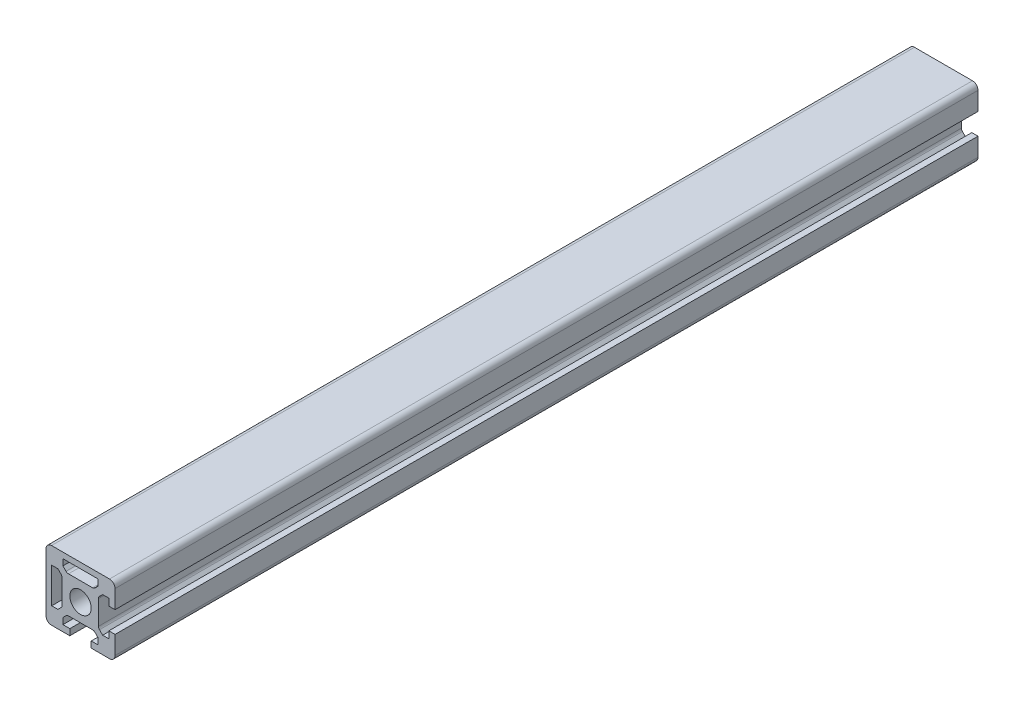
ISO-10303-21;
HEADER;
FILE_DESCRIPTION(('STEP AP214'),'2;1');
FILE_NAME('part.step','',(''),(''),'','','');
FILE_SCHEMA(('AUTOMOTIVE_DESIGN { 1 0 10303 214 1 1 1 1 }'));
ENDSEC;
DATA;
#1=APPLICATION_CONTEXT('core data for automotive mechanical design processes');
#2=APPLICATION_PROTOCOL_DEFINITION('international standard','automotive_design',2000,#1);
#3=PRODUCT_CONTEXT('',#1,'mechanical');
#4=PRODUCT('Part','Part','',(#3));
#5=PRODUCT_RELATED_PRODUCT_CATEGORY('part','',(#4));
#6=PRODUCT_DEFINITION_FORMATION('','',#4);
#7=PRODUCT_DEFINITION_CONTEXT('part definition',#1,'design');
#8=PRODUCT_DEFINITION('design','',#6,#7);
#9=PRODUCT_DEFINITION_SHAPE('','',#8);
#10=(LENGTH_UNIT() NAMED_UNIT(*) SI_UNIT(.MILLI.,.METRE.));
#11=(NAMED_UNIT(*) PLANE_ANGLE_UNIT() SI_UNIT($,.RADIAN.));
#12=(NAMED_UNIT(*) SI_UNIT($,.STERADIAN.) SOLID_ANGLE_UNIT());
#13=UNCERTAINTY_MEASURE_WITH_UNIT(LENGTH_MEASURE(1.E-05),#10,'distance_accuracy_value','');
#14=(GEOMETRIC_REPRESENTATION_CONTEXT(3) GLOBAL_UNCERTAINTY_ASSIGNED_CONTEXT((#13)) GLOBAL_UNIT_ASSIGNED_CONTEXT((#10,
#11,#12)) REPRESENTATION_CONTEXT('',''));
#15=CARTESIAN_POINT('',(0.,0.,0.));
#16=DIRECTION('',(0.,0.,1.));
#17=DIRECTION('',(1.,0.,0.));
#18=AXIS2_PLACEMENT_3D('',#15,#16,#17);
#19=CARTESIAN_POINT('',(-8.4,8.4,-249.));
#20=DIRECTION('',(0.,0.,1.));
#21=DIRECTION('',(1.,0.,0.));
#22=AXIS2_PLACEMENT_3D('',#19,#20,#21);
#23=CYLINDRICAL_SURFACE('',#22,1.6);
#24=CARTESIAN_POINT('',(-8.4,8.4,1.));
#25=DIRECTION('',(0.,0.,1.));
#26=DIRECTION('',(1.,0.,0.));
#27=AXIS2_PLACEMENT_3D('',#24,#25,#26);
#28=CIRCLE('',#27,1.6);
#29=CARTESIAN_POINT('',(-8.4,10.,1.));
#30=VERTEX_POINT('',#29);
#31=CARTESIAN_POINT('',(-10.,8.4,1.));
#32=VERTEX_POINT('',#31);
#33=EDGE_CURVE('E474',#30,#32,#28,.T.);
#34=ORIENTED_EDGE('',*,*,#33,.F.);
#35=DIRECTION('',(0.,0.,1.));
#36=VECTOR('',#35,1.);
#37=CARTESIAN_POINT('',(-8.4,10.,-249.));
#38=LINE('',#37,#36);
#39=CARTESIAN_POINT('',(-8.4,10.,-249.));
#40=VERTEX_POINT('',#39);
#41=EDGE_CURVE('E11',#40,#30,#38,.T.);
#42=ORIENTED_EDGE('',*,*,#41,.F.);
#43=CARTESIAN_POINT('',(-8.4,8.4,-249.));
#44=DIRECTION('',(0.,0.,1.));
#45=DIRECTION('',(1.,0.,0.));
#46=AXIS2_PLACEMENT_3D('',#43,#44,#45);
#47=CIRCLE('',#46,1.6);
#48=CARTESIAN_POINT('',(-10.,8.4,-249.));
#49=VERTEX_POINT('',#48);
#50=EDGE_CURVE('E477',#40,#49,#47,.T.);
#51=ORIENTED_EDGE('',*,*,#50,.T.);
#52=DIRECTION('',(0.,0.,1.));
#53=VECTOR('',#52,1.);
#54=CARTESIAN_POINT('',(-10.,8.4,-249.));
#55=LINE('',#54,#53);
#56=EDGE_CURVE('E36',#49,#32,#55,.T.);
#57=ORIENTED_EDGE('',*,*,#56,.T.);
#58=EDGE_LOOP('',(#34,#42,#51,#57));
#59=FACE_BOUND('',#58,.T.);
#60=ADVANCED_FACE('F33',(#59),#23,.T.);
#61=CARTESIAN_POINT('',(8.4,10.,-249.));
#62=DIRECTION('',(0.,1.,0.));
#63=DIRECTION('',(0.,0.,1.));
#64=AXIS2_PLACEMENT_3D('',#61,#62,#63);
#65=PLANE('',#64);
#66=DIRECTION('',(-1.,0.,0.));
#67=VECTOR('',#66,1.);
#68=CARTESIAN_POINT('',(8.4,10.,1.));
#69=LINE('',#68,#67);
#70=CARTESIAN_POINT('',(8.4,10.,1.));
#71=VERTEX_POINT('',#70);
#72=EDGE_CURVE('E481',#71,#30,#69,.T.);
#73=ORIENTED_EDGE('',*,*,#72,.F.);
#74=DIRECTION('',(0.,0.,1.));
#75=VECTOR('',#74,1.);
#76=CARTESIAN_POINT('',(8.4,10.,-249.));
#77=LINE('',#76,#75);
#78=CARTESIAN_POINT('',(8.4,10.,-249.));
#79=VERTEX_POINT('',#78);
#80=EDGE_CURVE('E41',#79,#71,#77,.T.);
#81=ORIENTED_EDGE('',*,*,#80,.F.);
#82=DIRECTION('',(-1.,0.,0.));
#83=VECTOR('',#82,1.);
#84=CARTESIAN_POINT('',(8.4,10.,-249.));
#85=LINE('',#84,#83);
#86=EDGE_CURVE('E571',#79,#40,#85,.T.);
#87=ORIENTED_EDGE('',*,*,#86,.T.);
#88=ORIENTED_EDGE('',*,*,#41,.T.);
#89=EDGE_LOOP('',(#73,#81,#87,#88));
#90=FACE_BOUND('',#89,.T.);
#91=ADVANCED_FACE('F738',(#90),#65,.T.);
#92=CARTESIAN_POINT('',(8.4,8.4,-249.));
#93=DIRECTION('',(0.,0.,1.));
#94=DIRECTION('',(1.,0.,0.));
#95=AXIS2_PLACEMENT_3D('',#92,#93,#94);
#96=CYLINDRICAL_SURFACE('',#95,1.6);
#97=CARTESIAN_POINT('',(8.4,8.4,1.));
#98=DIRECTION('',(0.,0.,1.));
#99=DIRECTION('',(1.,0.,0.));
#100=AXIS2_PLACEMENT_3D('',#97,#98,#99);
#101=CIRCLE('',#100,1.6);
#102=CARTESIAN_POINT('',(10.,8.4,1.));
#103=VERTEX_POINT('',#102);
#104=EDGE_CURVE('E663',#103,#71,#101,.T.);
#105=ORIENTED_EDGE('',*,*,#104,.F.);
#106=DIRECTION('',(0.,0.,1.));
#107=VECTOR('',#106,1.);
#108=CARTESIAN_POINT('',(10.,8.4,-249.));
#109=LINE('',#108,#107);
#110=CARTESIAN_POINT('',(10.,8.4,-249.));
#111=VERTEX_POINT('',#110);
#112=EDGE_CURVE('E669',#111,#103,#109,.T.);
#113=ORIENTED_EDGE('',*,*,#112,.F.);
#114=CARTESIAN_POINT('',(8.4,8.4,-249.));
#115=DIRECTION('',(0.,0.,1.));
#116=DIRECTION('',(1.,0.,0.));
#117=AXIS2_PLACEMENT_3D('',#114,#115,#116);
#118=CIRCLE('',#117,1.6);
#119=EDGE_CURVE('E568',#111,#79,#118,.T.);
#120=ORIENTED_EDGE('',*,*,#119,.T.);
#121=ORIENTED_EDGE('',*,*,#80,.T.);
#122=EDGE_LOOP('',(#105,#113,#120,#121));
#123=FACE_BOUND('',#122,.T.);
#124=ADVANCED_FACE('F854',(#123),#96,.T.);
#125=CARTESIAN_POINT('',(10.,3.1,-249.));
#126=DIRECTION('',(1.,0.,0.));
#127=DIRECTION('',(0.,0.,-1.));
#128=AXIS2_PLACEMENT_3D('',#125,#126,#127);
#129=PLANE('',#128);
#130=DIRECTION('',(0.,1.,0.));
#131=VECTOR('',#130,1.);
#132=CARTESIAN_POINT('',(10.,3.1,1.));
#133=LINE('',#132,#131);
#134=CARTESIAN_POINT('',(10.,3.1,1.));
#135=VERTEX_POINT('',#134);
#136=EDGE_CURVE('E660',#135,#103,#133,.T.);
#137=ORIENTED_EDGE('',*,*,#136,.F.);
#138=DIRECTION('',(0.,0.,1.));
#139=VECTOR('',#138,1.);
#140=CARTESIAN_POINT('',(10.,3.1,-249.));
#141=LINE('',#140,#139);
#142=CARTESIAN_POINT('',(10.,3.1,-249.));
#143=VERTEX_POINT('',#142);
#144=EDGE_CURVE('E671',#143,#135,#141,.T.);
#145=ORIENTED_EDGE('',*,*,#144,.F.);
#146=DIRECTION('',(0.,1.,0.));
#147=VECTOR('',#146,1.);
#148=CARTESIAN_POINT('',(10.,3.1,-249.));
#149=LINE('',#148,#147);
#150=EDGE_CURVE('E565',#143,#111,#149,.T.);
#151=ORIENTED_EDGE('',*,*,#150,.T.);
#152=ORIENTED_EDGE('',*,*,#112,.T.);
#153=EDGE_LOOP('',(#137,#145,#151,#152));
#154=FACE_BOUND('',#153,.T.);
#155=ADVANCED_FACE('F852',(#154),#129,.T.);
#156=CARTESIAN_POINT('',(8.2,3.1,-249.));
#157=DIRECTION('',(0.,-1.,0.));
#158=DIRECTION('',(0.,0.,-1.));
#159=AXIS2_PLACEMENT_3D('',#156,#157,#158);
#160=PLANE('',#159);
#161=DIRECTION('',(1.,0.,0.));
#162=VECTOR('',#161,1.);
#163=CARTESIAN_POINT('',(8.2,3.1,1.));
#164=LINE('',#163,#162);
#165=CARTESIAN_POINT('',(8.2,3.1,1.));
#166=VERTEX_POINT('',#165);
#167=EDGE_CURVE('E657',#166,#135,#164,.T.);
#168=ORIENTED_EDGE('',*,*,#167,.F.);
#169=DIRECTION('',(0.,0.,1.));
#170=VECTOR('',#169,1.);
#171=CARTESIAN_POINT('',(8.2,3.1,-249.));
#172=LINE('',#171,#170);
#173=CARTESIAN_POINT('',(8.2,3.1,-249.));
#174=VERTEX_POINT('',#173);
#175=EDGE_CURVE('E673',#174,#166,#172,.T.);
#176=ORIENTED_EDGE('',*,*,#175,.F.);
#177=DIRECTION('',(1.,0.,0.));
#178=VECTOR('',#177,1.);
#179=CARTESIAN_POINT('',(8.2,3.1,-249.));
#180=LINE('',#179,#178);
#181=EDGE_CURVE('E562',#174,#143,#180,.T.);
#182=ORIENTED_EDGE('',*,*,#181,.T.);
#183=ORIENTED_EDGE('',*,*,#144,.T.);
#184=EDGE_LOOP('',(#168,#176,#182,#183));
#185=FACE_BOUND('',#184,.T.);
#186=ADVANCED_FACE('F848',(#185),#160,.T.);
#187=CARTESIAN_POINT('',(8.2,5.1,-249.));
#188=DIRECTION('',(-1.,0.,0.));
#189=DIRECTION('',(0.,0.,1.));
#190=AXIS2_PLACEMENT_3D('',#187,#188,#189);
#191=PLANE('',#190);
#192=DIRECTION('',(0.,-1.,0.));
#193=VECTOR('',#192,1.);
#194=CARTESIAN_POINT('',(8.2,5.1,1.));
#195=LINE('',#194,#193);
#196=CARTESIAN_POINT('',(8.2,5.1,1.));
#197=VERTEX_POINT('',#196);
#198=EDGE_CURVE('E654',#197,#166,#195,.T.);
#199=ORIENTED_EDGE('',*,*,#198,.F.);
#200=DIRECTION('',(0.,0.,1.));
#201=VECTOR('',#200,1.);
#202=CARTESIAN_POINT('',(8.2,5.1,-249.));
#203=LINE('',#202,#201);
#204=CARTESIAN_POINT('',(8.2,5.1,-249.));
#205=VERTEX_POINT('',#204);
#206=EDGE_CURVE('E675',#205,#197,#203,.T.);
#207=ORIENTED_EDGE('',*,*,#206,.F.);
#208=DIRECTION('',(0.,-1.,0.));
#209=VECTOR('',#208,1.);
#210=CARTESIAN_POINT('',(8.2,5.1,-249.));
#211=LINE('',#210,#209);
#212=EDGE_CURVE('E559',#205,#174,#211,.T.);
#213=ORIENTED_EDGE('',*,*,#212,.T.);
#214=ORIENTED_EDGE('',*,*,#175,.T.);
#215=EDGE_LOOP('',(#199,#207,#213,#214));
#216=FACE_BOUND('',#215,.T.);
#217=ADVANCED_FACE('F844',(#216),#191,.T.);
#218=CARTESIAN_POINT('',(6.4,5.1,-249.));
#219=DIRECTION('',(0.,-1.,0.));
#220=DIRECTION('',(0.,0.,-1.));
#221=AXIS2_PLACEMENT_3D('',#218,#219,#220);
#222=PLANE('',#221);
#223=DIRECTION('',(1.,0.,0.));
#224=VECTOR('',#223,1.);
#225=CARTESIAN_POINT('',(6.4,5.1,1.));
#226=LINE('',#225,#224);
#227=CARTESIAN_POINT('',(6.4,5.1,1.));
#228=VERTEX_POINT('',#227);
#229=EDGE_CURVE('E651',#228,#197,#226,.T.);
#230=ORIENTED_EDGE('',*,*,#229,.F.);
#231=DIRECTION('',(0.,0.,1.));
#232=VECTOR('',#231,1.);
#233=CARTESIAN_POINT('',(6.4,5.1,-249.));
#234=LINE('',#233,#232);
#235=CARTESIAN_POINT('',(6.4,5.1,-249.));
#236=VERTEX_POINT('',#235);
#237=EDGE_CURVE('E677',#236,#228,#234,.T.);
#238=ORIENTED_EDGE('',*,*,#237,.F.);
#239=DIRECTION('',(1.,0.,0.));
#240=VECTOR('',#239,1.);
#241=CARTESIAN_POINT('',(6.4,5.1,-249.));
#242=LINE('',#241,#240);
#243=EDGE_CURVE('E556',#236,#205,#242,.T.);
#244=ORIENTED_EDGE('',*,*,#243,.T.);
#245=ORIENTED_EDGE('',*,*,#206,.T.);
#246=EDGE_LOOP('',(#230,#238,#244,#245));
#247=FACE_BOUND('',#246,.T.);
#248=ADVANCED_FACE('F840',(#247),#222,.T.);
#249=CARTESIAN_POINT('',(5.49289321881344,4.19289321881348,-249.));
#250=DIRECTION('',(0.707106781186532,-0.707106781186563,0.));
#251=DIRECTION('',(0.707106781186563,0.707106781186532,0.));
#252=AXIS2_PLACEMENT_3D('',#249,#250,#251);
#253=PLANE('',#252);
#254=DIRECTION('',(0.707106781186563,0.707106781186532,0.));
#255=VECTOR('',#254,1.);
#256=CARTESIAN_POINT('',(5.49289321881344,4.19289321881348,1.));
#257=LINE('',#256,#255);
#258=CARTESIAN_POINT('',(5.49289321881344,4.19289321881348,1.));
#259=VERTEX_POINT('',#258);
#260=EDGE_CURVE('E648',#259,#228,#257,.T.);
#261=ORIENTED_EDGE('',*,*,#260,.F.);
#262=DIRECTION('',(0.,0.,1.));
#263=VECTOR('',#262,1.);
#264=CARTESIAN_POINT('',(5.49289321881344,4.19289321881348,-249.));
#265=LINE('',#264,#263);
#266=CARTESIAN_POINT('',(5.49289321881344,4.19289321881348,-249.));
#267=VERTEX_POINT('',#266);
#268=EDGE_CURVE('E679',#267,#259,#265,.T.);
#269=ORIENTED_EDGE('',*,*,#268,.F.);
#270=DIRECTION('',(0.707106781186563,0.707106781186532,0.));
#271=VECTOR('',#270,1.);
#272=CARTESIAN_POINT('',(5.49289321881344,4.19289321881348,-249.));
#273=LINE('',#272,#271);
#274=EDGE_CURVE('E553',#267,#236,#273,.T.);
#275=ORIENTED_EDGE('',*,*,#274,.T.);
#276=ORIENTED_EDGE('',*,*,#237,.T.);
#277=EDGE_LOOP('',(#261,#269,#275,#276));
#278=FACE_BOUND('',#277,.T.);
#279=ADVANCED_FACE('F836',(#278),#253,.T.);
#280=CARTESIAN_POINT('',(6.2,3.48578643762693,-249.));
#281=DIRECTION('',(0.,0.,1.));
#282=DIRECTION('',(1.,0.,0.));
#283=AXIS2_PLACEMENT_3D('',#280,#281,#282);
#284=CYLINDRICAL_SURFACE('',#283,1.00000000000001);
#285=CARTESIAN_POINT('',(6.2,3.48578643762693,1.));
#286=DIRECTION('',(0.,0.,-1.));
#287=DIRECTION('',(-1.,0.,0.));
#288=AXIS2_PLACEMENT_3D('',#285,#286,#287);
#289=CIRCLE('',#288,1.00000000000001);
#290=CARTESIAN_POINT('',(5.19999999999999,3.48578643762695,1.));
#291=VERTEX_POINT('',#290);
#292=EDGE_CURVE('E645',#291,#259,#289,.T.);
#293=ORIENTED_EDGE('',*,*,#292,.F.);
#294=DIRECTION('',(0.,0.,1.));
#295=VECTOR('',#294,1.);
#296=CARTESIAN_POINT('',(5.19999999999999,3.48578643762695,-249.));
#297=LINE('',#296,#295);
#298=CARTESIAN_POINT('',(5.19999999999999,3.48578643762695,-249.));
#299=VERTEX_POINT('',#298);
#300=EDGE_CURVE('E681',#299,#291,#297,.T.);
#301=ORIENTED_EDGE('',*,*,#300,.F.);
#302=CARTESIAN_POINT('',(6.2,3.48578643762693,-249.));
#303=DIRECTION('',(0.,0.,-1.));
#304=DIRECTION('',(-1.,0.,0.));
#305=AXIS2_PLACEMENT_3D('',#302,#303,#304);
#306=CIRCLE('',#305,1.00000000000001);
#307=EDGE_CURVE('E550',#299,#267,#306,.T.);
#308=ORIENTED_EDGE('',*,*,#307,.T.);
#309=ORIENTED_EDGE('',*,*,#268,.T.);
#310=EDGE_LOOP('',(#293,#301,#308,#309));
#311=FACE_BOUND('',#310,.T.);
#312=ADVANCED_FACE('F832',(#311),#284,.F.);
#313=CARTESIAN_POINT('',(5.2,-3.48578643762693,-249.));
#314=DIRECTION('',(1.,0.,0.));
#315=DIRECTION('',(0.,0.,-1.));
#316=AXIS2_PLACEMENT_3D('',#313,#314,#315);
#317=PLANE('',#316);
#318=DIRECTION('',(0.,1.,0.));
#319=VECTOR('',#318,1.);
#320=CARTESIAN_POINT('',(5.2,-3.48578643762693,1.));
#321=LINE('',#320,#319);
#322=CARTESIAN_POINT('',(5.2,-3.48578643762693,1.));
#323=VERTEX_POINT('',#322);
#324=EDGE_CURVE('E642',#323,#291,#321,.T.);
#325=ORIENTED_EDGE('',*,*,#324,.F.);
#326=DIRECTION('',(0.,0.,1.));
#327=VECTOR('',#326,1.);
#328=CARTESIAN_POINT('',(5.2,-3.48578643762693,-249.));
#329=LINE('',#328,#327);
#330=CARTESIAN_POINT('',(5.2,-3.48578643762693,-249.));
#331=VERTEX_POINT('',#330);
#332=EDGE_CURVE('E683',#331,#323,#329,.T.);
#333=ORIENTED_EDGE('',*,*,#332,.F.);
#334=DIRECTION('',(0.,1.,0.));
#335=VECTOR('',#334,1.);
#336=CARTESIAN_POINT('',(5.2,-3.48578643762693,-249.));
#337=LINE('',#336,#335);
#338=EDGE_CURVE('E547',#331,#299,#337,.T.);
#339=ORIENTED_EDGE('',*,*,#338,.T.);
#340=ORIENTED_EDGE('',*,*,#300,.T.);
#341=EDGE_LOOP('',(#325,#333,#339,#340));
#342=FACE_BOUND('',#341,.T.);
#343=ADVANCED_FACE('F828',(#342),#317,.T.);
#344=CARTESIAN_POINT('',(6.2,-3.48578643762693,-249.));
#345=DIRECTION('',(0.,0.,1.));
#346=DIRECTION('',(1.,0.,0.));
#347=AXIS2_PLACEMENT_3D('',#344,#345,#346);
#348=CYLINDRICAL_SURFACE('',#347,1.);
#349=CARTESIAN_POINT('',(6.2,-3.48578643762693,1.));
#350=DIRECTION('',(0.,0.,-1.));
#351=DIRECTION('',(-1.,0.,0.));
#352=AXIS2_PLACEMENT_3D('',#349,#350,#351);
#353=CIRCLE('',#352,1.);
#354=CARTESIAN_POINT('',(5.49289321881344,-4.19289321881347,1.));
#355=VERTEX_POINT('',#354);
#356=EDGE_CURVE('E639',#355,#323,#353,.T.);
#357=ORIENTED_EDGE('',*,*,#356,.F.);
#358=DIRECTION('',(0.,0.,1.));
#359=VECTOR('',#358,1.);
#360=CARTESIAN_POINT('',(5.49289321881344,-4.19289321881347,-249.));
#361=LINE('',#360,#359);
#362=CARTESIAN_POINT('',(5.49289321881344,-4.19289321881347,-249.));
#363=VERTEX_POINT('',#362);
#364=EDGE_CURVE('E685',#363,#355,#361,.T.);
#365=ORIENTED_EDGE('',*,*,#364,.F.);
#366=CARTESIAN_POINT('',(6.2,-3.48578643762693,-249.));
#367=DIRECTION('',(0.,0.,-1.));
#368=DIRECTION('',(-1.,0.,0.));
#369=AXIS2_PLACEMENT_3D('',#366,#367,#368);
#370=CIRCLE('',#369,1.);
#371=EDGE_CURVE('E544',#363,#331,#370,.T.);
#372=ORIENTED_EDGE('',*,*,#371,.T.);
#373=ORIENTED_EDGE('',*,*,#332,.T.);
#374=EDGE_LOOP('',(#357,#365,#372,#373));
#375=FACE_BOUND('',#374,.T.);
#376=ADVANCED_FACE('F824',(#375),#348,.F.);
#377=CARTESIAN_POINT('',(6.4,-5.1,-249.));
#378=DIRECTION('',(0.707106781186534,0.707106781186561,0.));
#379=DIRECTION('',(-0.707106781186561,0.707106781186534,0.));
#380=AXIS2_PLACEMENT_3D('',#377,#378,#379);
#381=PLANE('',#380);
#382=DIRECTION('',(-0.707106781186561,0.707106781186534,0.));
#383=VECTOR('',#382,1.);
#384=CARTESIAN_POINT('',(6.4,-5.1,1.));
#385=LINE('',#384,#383);
#386=CARTESIAN_POINT('',(6.4,-5.1,1.));
#387=VERTEX_POINT('',#386);
#388=EDGE_CURVE('E636',#387,#355,#385,.T.);
#389=ORIENTED_EDGE('',*,*,#388,.F.);
#390=DIRECTION('',(0.,0.,1.));
#391=VECTOR('',#390,1.);
#392=CARTESIAN_POINT('',(6.4,-5.1,-249.));
#393=LINE('',#392,#391);
#394=CARTESIAN_POINT('',(6.4,-5.1,-249.));
#395=VERTEX_POINT('',#394);
#396=EDGE_CURVE('E687',#395,#387,#393,.T.);
#397=ORIENTED_EDGE('',*,*,#396,.F.);
#398=DIRECTION('',(-0.707106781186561,0.707106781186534,0.));
#399=VECTOR('',#398,1.);
#400=CARTESIAN_POINT('',(6.4,-5.1,-249.));
#401=LINE('',#400,#399);
#402=EDGE_CURVE('E541',#395,#363,#401,.T.);
#403=ORIENTED_EDGE('',*,*,#402,.T.);
#404=ORIENTED_EDGE('',*,*,#364,.T.);
#405=EDGE_LOOP('',(#389,#397,#403,#404));
#406=FACE_BOUND('',#405,.T.);
#407=ADVANCED_FACE('F820',(#406),#381,.T.);
#408=CARTESIAN_POINT('',(8.2,-5.1,-249.));
#409=DIRECTION('',(0.,1.,0.));
#410=DIRECTION('',(0.,0.,1.));
#411=AXIS2_PLACEMENT_3D('',#408,#409,#410);
#412=PLANE('',#411);
#413=DIRECTION('',(-1.,0.,0.));
#414=VECTOR('',#413,1.);
#415=CARTESIAN_POINT('',(8.2,-5.1,1.));
#416=LINE('',#415,#414);
#417=CARTESIAN_POINT('',(8.2,-5.1,1.));
#418=VERTEX_POINT('',#417);
#419=EDGE_CURVE('E633',#418,#387,#416,.T.);
#420=ORIENTED_EDGE('',*,*,#419,.F.);
#421=DIRECTION('',(0.,0.,1.));
#422=VECTOR('',#421,1.);
#423=CARTESIAN_POINT('',(8.2,-5.1,-249.));
#424=LINE('',#423,#422);
#425=CARTESIAN_POINT('',(8.2,-5.1,-249.));
#426=VERTEX_POINT('',#425);
#427=EDGE_CURVE('E689',#426,#418,#424,.T.);
#428=ORIENTED_EDGE('',*,*,#427,.F.);
#429=DIRECTION('',(-1.,0.,0.));
#430=VECTOR('',#429,1.);
#431=CARTESIAN_POINT('',(8.2,-5.1,-249.));
#432=LINE('',#431,#430);
#433=EDGE_CURVE('E538',#426,#395,#432,.T.);
#434=ORIENTED_EDGE('',*,*,#433,.T.);
#435=ORIENTED_EDGE('',*,*,#396,.T.);
#436=EDGE_LOOP('',(#420,#428,#434,#435));
#437=FACE_BOUND('',#436,.T.);
#438=ADVANCED_FACE('F816',(#437),#412,.T.);
#439=CARTESIAN_POINT('',(8.2,-3.1,-249.));
#440=DIRECTION('',(-1.,0.,0.));
#441=DIRECTION('',(0.,0.,1.));
#442=AXIS2_PLACEMENT_3D('',#439,#440,#441);
#443=PLANE('',#442);
#444=DIRECTION('',(0.,-1.,0.));
#445=VECTOR('',#444,1.);
#446=CARTESIAN_POINT('',(8.2,-3.1,1.));
#447=LINE('',#446,#445);
#448=CARTESIAN_POINT('',(8.2,-3.1,1.));
#449=VERTEX_POINT('',#448);
#450=EDGE_CURVE('E630',#449,#418,#447,.T.);
#451=ORIENTED_EDGE('',*,*,#450,.F.);
#452=DIRECTION('',(0.,0.,1.));
#453=VECTOR('',#452,1.);
#454=CARTESIAN_POINT('',(8.2,-3.1,-249.));
#455=LINE('',#454,#453);
#456=CARTESIAN_POINT('',(8.2,-3.1,-249.));
#457=VERTEX_POINT('',#456);
#458=EDGE_CURVE('E691',#457,#449,#455,.T.);
#459=ORIENTED_EDGE('',*,*,#458,.F.);
#460=DIRECTION('',(0.,-1.,0.));
#461=VECTOR('',#460,1.);
#462=CARTESIAN_POINT('',(8.2,-3.1,-249.));
#463=LINE('',#462,#461);
#464=EDGE_CURVE('E535',#457,#426,#463,.T.);
#465=ORIENTED_EDGE('',*,*,#464,.T.);
#466=ORIENTED_EDGE('',*,*,#427,.T.);
#467=EDGE_LOOP('',(#451,#459,#465,#466));
#468=FACE_BOUND('',#467,.T.);
#469=ADVANCED_FACE('F812',(#468),#443,.T.);
#470=CARTESIAN_POINT('',(10.,-3.1,-249.));
#471=DIRECTION('',(0.,1.,0.));
#472=DIRECTION('',(0.,0.,1.));
#473=AXIS2_PLACEMENT_3D('',#470,#471,#472);
#474=PLANE('',#473);
#475=DIRECTION('',(-1.,0.,0.));
#476=VECTOR('',#475,1.);
#477=CARTESIAN_POINT('',(10.,-3.1,1.));
#478=LINE('',#477,#476);
#479=CARTESIAN_POINT('',(10.,-3.1,1.));
#480=VERTEX_POINT('',#479);
#481=EDGE_CURVE('E627',#480,#449,#478,.T.);
#482=ORIENTED_EDGE('',*,*,#481,.F.);
#483=DIRECTION('',(0.,0.,1.));
#484=VECTOR('',#483,1.);
#485=CARTESIAN_POINT('',(10.,-3.1,-249.));
#486=LINE('',#485,#484);
#487=CARTESIAN_POINT('',(10.,-3.1,-249.));
#488=VERTEX_POINT('',#487);
#489=EDGE_CURVE('E693',#488,#480,#486,.T.);
#490=ORIENTED_EDGE('',*,*,#489,.F.);
#491=DIRECTION('',(-1.,0.,0.));
#492=VECTOR('',#491,1.);
#493=CARTESIAN_POINT('',(10.,-3.1,-249.));
#494=LINE('',#493,#492);
#495=EDGE_CURVE('E532',#488,#457,#494,.T.);
#496=ORIENTED_EDGE('',*,*,#495,.T.);
#497=ORIENTED_EDGE('',*,*,#458,.T.);
#498=EDGE_LOOP('',(#482,#490,#496,#497));
#499=FACE_BOUND('',#498,.T.);
#500=ADVANCED_FACE('F808',(#499),#474,.T.);
#501=CARTESIAN_POINT('',(10.,-8.4,-249.));
#502=DIRECTION('',(1.,0.,0.));
#503=DIRECTION('',(0.,0.,-1.));
#504=AXIS2_PLACEMENT_3D('',#501,#502,#503);
#505=PLANE('',#504);
#506=DIRECTION('',(0.,1.,0.));
#507=VECTOR('',#506,1.);
#508=CARTESIAN_POINT('',(10.,-8.4,1.));
#509=LINE('',#508,#507);
#510=CARTESIAN_POINT('',(10.,-8.4,1.));
#511=VERTEX_POINT('',#510);
#512=EDGE_CURVE('E624',#511,#480,#509,.T.);
#513=ORIENTED_EDGE('',*,*,#512,.F.);
#514=DIRECTION('',(0.,0.,1.));
#515=VECTOR('',#514,1.);
#516=CARTESIAN_POINT('',(10.,-8.4,-249.));
#517=LINE('',#516,#515);
#518=CARTESIAN_POINT('',(10.,-8.4,-249.));
#519=VERTEX_POINT('',#518);
#520=EDGE_CURVE('E695',#519,#511,#517,.T.);
#521=ORIENTED_EDGE('',*,*,#520,.F.);
#522=DIRECTION('',(0.,1.,0.));
#523=VECTOR('',#522,1.);
#524=CARTESIAN_POINT('',(10.,-8.4,-249.));
#525=LINE('',#524,#523);
#526=EDGE_CURVE('E529',#519,#488,#525,.T.);
#527=ORIENTED_EDGE('',*,*,#526,.T.);
#528=ORIENTED_EDGE('',*,*,#489,.T.);
#529=EDGE_LOOP('',(#513,#521,#527,#528));
#530=FACE_BOUND('',#529,.T.);
#531=ADVANCED_FACE('F804',(#530),#505,.T.);
#532=CARTESIAN_POINT('',(8.4,-8.4,-249.));
#533=DIRECTION('',(0.,0.,1.));
#534=DIRECTION('',(1.,0.,0.));
#535=AXIS2_PLACEMENT_3D('',#532,#533,#534);
#536=CYLINDRICAL_SURFACE('',#535,1.6);
#537=CARTESIAN_POINT('',(8.4,-8.4,1.));
#538=DIRECTION('',(0.,0.,1.));
#539=DIRECTION('',(1.,0.,0.));
#540=AXIS2_PLACEMENT_3D('',#537,#538,#539);
#541=CIRCLE('',#540,1.6);
#542=CARTESIAN_POINT('',(8.4,-10.,1.));
#543=VERTEX_POINT('',#542);
#544=EDGE_CURVE('E621',#543,#511,#541,.T.);
#545=ORIENTED_EDGE('',*,*,#544,.F.);
#546=DIRECTION('',(0.,0.,1.));
#547=VECTOR('',#546,1.);
#548=CARTESIAN_POINT('',(8.4,-10.,-249.));
#549=LINE('',#548,#547);
#550=CARTESIAN_POINT('',(8.4,-10.,-249.));
#551=VERTEX_POINT('',#550);
#552=EDGE_CURVE('E697',#551,#543,#549,.T.);
#553=ORIENTED_EDGE('',*,*,#552,.F.);
#554=CARTESIAN_POINT('',(8.4,-8.4,-249.));
#555=DIRECTION('',(0.,0.,1.));
#556=DIRECTION('',(1.,0.,0.));
#557=AXIS2_PLACEMENT_3D('',#554,#555,#556);
#558=CIRCLE('',#557,1.6);
#559=EDGE_CURVE('E526',#551,#519,#558,.T.);
#560=ORIENTED_EDGE('',*,*,#559,.T.);
#561=ORIENTED_EDGE('',*,*,#520,.T.);
#562=EDGE_LOOP('',(#545,#553,#560,#561));
#563=FACE_BOUND('',#562,.T.);
#564=ADVANCED_FACE('F800',(#563),#536,.T.);
#565=CARTESIAN_POINT('',(3.1,-10.,-249.));
#566=DIRECTION('',(0.,-1.,0.));
#567=DIRECTION('',(0.,0.,-1.));
#568=AXIS2_PLACEMENT_3D('',#565,#566,#567);
#569=PLANE('',#568);
#570=DIRECTION('',(1.,0.,0.));
#571=VECTOR('',#570,1.);
#572=CARTESIAN_POINT('',(3.1,-10.,1.));
#573=LINE('',#572,#571);
#574=CARTESIAN_POINT('',(3.1,-10.,1.));
#575=VERTEX_POINT('',#574);
#576=EDGE_CURVE('E618',#575,#543,#573,.T.);
#577=ORIENTED_EDGE('',*,*,#576,.F.);
#578=DIRECTION('',(0.,0.,1.));
#579=VECTOR('',#578,1.);
#580=CARTESIAN_POINT('',(3.1,-10.,-249.));
#581=LINE('',#580,#579);
#582=CARTESIAN_POINT('',(3.1,-10.,-249.));
#583=VERTEX_POINT('',#582);
#584=EDGE_CURVE('E699',#583,#575,#581,.T.);
#585=ORIENTED_EDGE('',*,*,#584,.F.);
#586=DIRECTION('',(1.,0.,0.));
#587=VECTOR('',#586,1.);
#588=CARTESIAN_POINT('',(3.1,-10.,-249.));
#589=LINE('',#588,#587);
#590=EDGE_CURVE('E523',#583,#551,#589,.T.);
#591=ORIENTED_EDGE('',*,*,#590,.T.);
#592=ORIENTED_EDGE('',*,*,#552,.T.);
#593=EDGE_LOOP('',(#577,#585,#591,#592));
#594=FACE_BOUND('',#593,.T.);
#595=ADVANCED_FACE('F796',(#594),#569,.T.);
#596=CARTESIAN_POINT('',(3.1,-8.2,-249.));
#597=DIRECTION('',(-1.,0.,0.));
#598=DIRECTION('',(0.,0.,1.));
#599=AXIS2_PLACEMENT_3D('',#596,#597,#598);
#600=PLANE('',#599);
#601=DIRECTION('',(0.,-1.,0.));
#602=VECTOR('',#601,1.);
#603=CARTESIAN_POINT('',(3.1,-8.2,1.));
#604=LINE('',#603,#602);
#605=CARTESIAN_POINT('',(3.1,-8.2,1.));
#606=VERTEX_POINT('',#605);
#607=EDGE_CURVE('E615',#606,#575,#604,.T.);
#608=ORIENTED_EDGE('',*,*,#607,.F.);
#609=DIRECTION('',(0.,0.,1.));
#610=VECTOR('',#609,1.);
#611=CARTESIAN_POINT('',(3.1,-8.2,-249.));
#612=LINE('',#611,#610);
#613=CARTESIAN_POINT('',(3.1,-8.2,-249.));
#614=VERTEX_POINT('',#613);
#615=EDGE_CURVE('E701',#614,#606,#612,.T.);
#616=ORIENTED_EDGE('',*,*,#615,.F.);
#617=DIRECTION('',(0.,-1.,0.));
#618=VECTOR('',#617,1.);
#619=CARTESIAN_POINT('',(3.1,-8.2,-249.));
#620=LINE('',#619,#618);
#621=EDGE_CURVE('E520',#614,#583,#620,.T.);
#622=ORIENTED_EDGE('',*,*,#621,.T.);
#623=ORIENTED_EDGE('',*,*,#584,.T.);
#624=EDGE_LOOP('',(#608,#616,#622,#623));
#625=FACE_BOUND('',#624,.T.);
#626=ADVANCED_FACE('F792',(#625),#600,.T.);
#627=CARTESIAN_POINT('',(5.1,-8.2,-249.));
#628=DIRECTION('',(0.,1.,0.));
#629=DIRECTION('',(0.,0.,1.));
#630=AXIS2_PLACEMENT_3D('',#627,#628,#629);
#631=PLANE('',#630);
#632=DIRECTION('',(-1.,0.,0.));
#633=VECTOR('',#632,1.);
#634=CARTESIAN_POINT('',(5.1,-8.2,1.));
#635=LINE('',#634,#633);
#636=CARTESIAN_POINT('',(5.1,-8.2,1.));
#637=VERTEX_POINT('',#636);
#638=EDGE_CURVE('E612',#637,#606,#635,.T.);
#639=ORIENTED_EDGE('',*,*,#638,.F.);
#640=DIRECTION('',(0.,0.,1.));
#641=VECTOR('',#640,1.);
#642=CARTESIAN_POINT('',(5.1,-8.2,-249.));
#643=LINE('',#642,#641);
#644=CARTESIAN_POINT('',(5.1,-8.2,-249.));
#645=VERTEX_POINT('',#644);
#646=EDGE_CURVE('E703',#645,#637,#643,.T.);
#647=ORIENTED_EDGE('',*,*,#646,.F.);
#648=DIRECTION('',(-1.,0.,0.));
#649=VECTOR('',#648,1.);
#650=CARTESIAN_POINT('',(5.1,-8.2,-249.));
#651=LINE('',#650,#649);
#652=EDGE_CURVE('E517',#645,#614,#651,.T.);
#653=ORIENTED_EDGE('',*,*,#652,.T.);
#654=ORIENTED_EDGE('',*,*,#615,.T.);
#655=EDGE_LOOP('',(#639,#647,#653,#654));
#656=FACE_BOUND('',#655,.T.);
#657=ADVANCED_FACE('F788',(#656),#631,.T.);
#658=CARTESIAN_POINT('',(5.1,-6.4,-249.));
#659=DIRECTION('',(-1.,0.,0.));
#660=DIRECTION('',(0.,0.,1.));
#661=AXIS2_PLACEMENT_3D('',#658,#659,#660);
#662=PLANE('',#661);
#663=DIRECTION('',(0.,-1.,0.));
#664=VECTOR('',#663,1.);
#665=CARTESIAN_POINT('',(5.1,-6.4,1.));
#666=LINE('',#665,#664);
#667=CARTESIAN_POINT('',(5.1,-6.4,1.));
#668=VERTEX_POINT('',#667);
#669=EDGE_CURVE('E609',#668,#637,#666,.T.);
#670=ORIENTED_EDGE('',*,*,#669,.F.);
#671=DIRECTION('',(0.,0.,1.));
#672=VECTOR('',#671,1.);
#673=CARTESIAN_POINT('',(5.1,-6.4,-249.));
#674=LINE('',#673,#672);
#675=CARTESIAN_POINT('',(5.1,-6.4,-249.));
#676=VERTEX_POINT('',#675);
#677=EDGE_CURVE('E705',#676,#668,#674,.T.);
#678=ORIENTED_EDGE('',*,*,#677,.F.);
#679=DIRECTION('',(0.,-1.,0.));
#680=VECTOR('',#679,1.);
#681=CARTESIAN_POINT('',(5.1,-6.4,-249.));
#682=LINE('',#681,#680);
#683=EDGE_CURVE('E514',#676,#645,#682,.T.);
#684=ORIENTED_EDGE('',*,*,#683,.T.);
#685=ORIENTED_EDGE('',*,*,#646,.T.);
#686=EDGE_LOOP('',(#670,#678,#684,#685));
#687=FACE_BOUND('',#686,.T.);
#688=ADVANCED_FACE('F784',(#687),#662,.T.);
#689=CARTESIAN_POINT('',(4.19289321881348,-5.49289321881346,-249.));
#690=DIRECTION('',(-0.707106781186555,-0.70710678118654,0.));
#691=DIRECTION('',(0.70710678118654,-0.707106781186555,0.));
#692=AXIS2_PLACEMENT_3D('',#689,#690,#691);
#693=PLANE('',#692);
#694=DIRECTION('',(0.70710678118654,-0.707106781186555,0.));
#695=VECTOR('',#694,1.);
#696=CARTESIAN_POINT('',(4.19289321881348,-5.49289321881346,1.));
#697=LINE('',#696,#695);
#698=CARTESIAN_POINT('',(4.19289321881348,-5.49289321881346,1.));
#699=VERTEX_POINT('',#698);
#700=EDGE_CURVE('E606',#699,#668,#697,.T.);
#701=ORIENTED_EDGE('',*,*,#700,.F.);
#702=DIRECTION('',(0.,0.,1.));
#703=VECTOR('',#702,1.);
#704=CARTESIAN_POINT('',(4.19289321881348,-5.49289321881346,-249.));
#705=LINE('',#704,#703);
#706=CARTESIAN_POINT('',(4.19289321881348,-5.49289321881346,-249.));
#707=VERTEX_POINT('',#706);
#708=EDGE_CURVE('E707',#707,#699,#705,.T.);
#709=ORIENTED_EDGE('',*,*,#708,.F.);
#710=DIRECTION('',(0.70710678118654,-0.707106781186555,0.));
#711=VECTOR('',#710,1.);
#712=CARTESIAN_POINT('',(4.19289321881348,-5.49289321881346,-249.));
#713=LINE('',#712,#711);
#714=EDGE_CURVE('E511',#707,#676,#713,.T.);
#715=ORIENTED_EDGE('',*,*,#714,.T.);
#716=ORIENTED_EDGE('',*,*,#677,.T.);
#717=EDGE_LOOP('',(#701,#709,#715,#716));
#718=FACE_BOUND('',#717,.T.);
#719=ADVANCED_FACE('F780',(#718),#693,.T.);
#720=CARTESIAN_POINT('',(3.48578643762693,-6.2,-249.));
#721=DIRECTION('',(0.,0.,1.));
#722=DIRECTION('',(1.,0.,0.));
#723=AXIS2_PLACEMENT_3D('',#720,#721,#722);
#724=CYLINDRICAL_SURFACE('',#723,0.999999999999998);
#725=CARTESIAN_POINT('',(3.48578643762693,-6.2,1.));
#726=DIRECTION('',(0.,0.,-1.));
#727=DIRECTION('',(-1.,0.,0.));
#728=AXIS2_PLACEMENT_3D('',#725,#726,#727);
#729=CIRCLE('',#728,0.999999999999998);
#730=CARTESIAN_POINT('',(3.48578643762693,-5.2,1.));
#731=VERTEX_POINT('',#730);
#732=EDGE_CURVE('E603',#731,#699,#729,.T.);
#733=ORIENTED_EDGE('',*,*,#732,.F.);
#734=DIRECTION('',(0.,0.,1.));
#735=VECTOR('',#734,1.);
#736=CARTESIAN_POINT('',(3.48578643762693,-5.2,-249.));
#737=LINE('',#736,#735);
#738=CARTESIAN_POINT('',(3.48578643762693,-5.2,-249.));
#739=VERTEX_POINT('',#738);
#740=EDGE_CURVE('E709',#739,#731,#737,.T.);
#741=ORIENTED_EDGE('',*,*,#740,.F.);
#742=CARTESIAN_POINT('',(3.48578643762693,-6.2,-249.));
#743=DIRECTION('',(0.,0.,-1.));
#744=DIRECTION('',(-1.,0.,0.));
#745=AXIS2_PLACEMENT_3D('',#742,#743,#744);
#746=CIRCLE('',#745,0.999999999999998);
#747=EDGE_CURVE('E508',#739,#707,#746,.T.);
#748=ORIENTED_EDGE('',*,*,#747,.T.);
#749=ORIENTED_EDGE('',*,*,#708,.T.);
#750=EDGE_LOOP('',(#733,#741,#748,#749));
#751=FACE_BOUND('',#750,.T.);
#752=ADVANCED_FACE('F776',(#751),#724,.F.);
#753=CARTESIAN_POINT('',(-3.48578643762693,-5.2,-249.));
#754=DIRECTION('',(0.,-1.,0.));
#755=DIRECTION('',(0.,0.,-1.));
#756=AXIS2_PLACEMENT_3D('',#753,#754,#755);
#757=PLANE('',#756);
#758=DIRECTION('',(1.,0.,0.));
#759=VECTOR('',#758,1.);
#760=CARTESIAN_POINT('',(-3.48578643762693,-5.2,1.));
#761=LINE('',#760,#759);
#762=CARTESIAN_POINT('',(-3.48578643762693,-5.2,1.));
#763=VERTEX_POINT('',#762);
#764=EDGE_CURVE('E600',#763,#731,#761,.T.);
#765=ORIENTED_EDGE('',*,*,#764,.F.);
#766=DIRECTION('',(0.,0.,1.));
#767=VECTOR('',#766,1.);
#768=CARTESIAN_POINT('',(-3.48578643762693,-5.2,-249.));
#769=LINE('',#768,#767);
#770=CARTESIAN_POINT('',(-3.48578643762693,-5.2,-249.));
#771=VERTEX_POINT('',#770);
#772=EDGE_CURVE('E711',#771,#763,#769,.T.);
#773=ORIENTED_EDGE('',*,*,#772,.F.);
#774=DIRECTION('',(1.,0.,0.));
#775=VECTOR('',#774,1.);
#776=CARTESIAN_POINT('',(-3.48578643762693,-5.2,-249.));
#777=LINE('',#776,#775);
#778=EDGE_CURVE('E505',#771,#739,#777,.T.);
#779=ORIENTED_EDGE('',*,*,#778,.T.);
#780=ORIENTED_EDGE('',*,*,#740,.T.);
#781=EDGE_LOOP('',(#765,#773,#779,#780));
#782=FACE_BOUND('',#781,.T.);
#783=ADVANCED_FACE('F772',(#782),#757,.T.);
#784=CARTESIAN_POINT('',(-3.48578643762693,-6.2,-249.));
#785=DIRECTION('',(0.,0.,1.));
#786=DIRECTION('',(1.,0.,0.));
#787=AXIS2_PLACEMENT_3D('',#784,#785,#786);
#788=CYLINDRICAL_SURFACE('',#787,1.00000000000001);
#789=CARTESIAN_POINT('',(-3.48578643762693,-6.2,1.));
#790=DIRECTION('',(0.,0.,-1.));
#791=DIRECTION('',(-1.,0.,0.));
#792=AXIS2_PLACEMENT_3D('',#789,#790,#791);
#793=CIRCLE('',#792,1.00000000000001);
#794=CARTESIAN_POINT('',(-4.19289321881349,-5.49289321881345,1.));
#795=VERTEX_POINT('',#794);
#796=EDGE_CURVE('E597',#795,#763,#793,.T.);
#797=ORIENTED_EDGE('',*,*,#796,.F.);
#798=DIRECTION('',(0.,0.,1.));
#799=VECTOR('',#798,1.);
#800=CARTESIAN_POINT('',(-4.19289321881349,-5.49289321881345,-249.));
#801=LINE('',#800,#799);
#802=CARTESIAN_POINT('',(-4.19289321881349,-5.49289321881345,-249.));
#803=VERTEX_POINT('',#802);
#804=EDGE_CURVE('E713',#803,#795,#801,.T.);
#805=ORIENTED_EDGE('',*,*,#804,.F.);
#806=CARTESIAN_POINT('',(-3.48578643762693,-6.2,-249.));
#807=DIRECTION('',(0.,0.,-1.));
#808=DIRECTION('',(-1.,0.,0.));
#809=AXIS2_PLACEMENT_3D('',#806,#807,#808);
#810=CIRCLE('',#809,1.00000000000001);
#811=EDGE_CURVE('E502',#803,#771,#810,.T.);
#812=ORIENTED_EDGE('',*,*,#811,.T.);
#813=ORIENTED_EDGE('',*,*,#772,.T.);
#814=EDGE_LOOP('',(#797,#805,#812,#813));
#815=FACE_BOUND('',#814,.T.);
#816=ADVANCED_FACE('F768',(#815),#788,.F.);
#817=CARTESIAN_POINT('',(-5.1,-6.4,-249.));
#818=DIRECTION('',(0.707106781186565,-0.70710678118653,0.));
#819=DIRECTION('',(0.70710678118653,0.707106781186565,0.));
#820=AXIS2_PLACEMENT_3D('',#817,#818,#819);
#821=PLANE('',#820);
#822=DIRECTION('',(0.70710678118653,0.707106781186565,0.));
#823=VECTOR('',#822,1.);
#824=CARTESIAN_POINT('',(-5.1,-6.4,1.));
#825=LINE('',#824,#823);
#826=CARTESIAN_POINT('',(-5.1,-6.4,1.));
#827=VERTEX_POINT('',#826);
#828=EDGE_CURVE('E594',#827,#795,#825,.T.);
#829=ORIENTED_EDGE('',*,*,#828,.F.);
#830=DIRECTION('',(0.,0.,1.));
#831=VECTOR('',#830,1.);
#832=CARTESIAN_POINT('',(-5.1,-6.4,-249.));
#833=LINE('',#832,#831);
#834=CARTESIAN_POINT('',(-5.1,-6.4,-249.));
#835=VERTEX_POINT('',#834);
#836=EDGE_CURVE('E715',#835,#827,#833,.T.);
#837=ORIENTED_EDGE('',*,*,#836,.F.);
#838=DIRECTION('',(0.70710678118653,0.707106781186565,0.));
#839=VECTOR('',#838,1.);
#840=CARTESIAN_POINT('',(-5.1,-6.4,-249.));
#841=LINE('',#840,#839);
#842=EDGE_CURVE('E499',#835,#803,#841,.T.);
#843=ORIENTED_EDGE('',*,*,#842,.T.);
#844=ORIENTED_EDGE('',*,*,#804,.T.);
#845=EDGE_LOOP('',(#829,#837,#843,#844));
#846=FACE_BOUND('',#845,.T.);
#847=ADVANCED_FACE('F764',(#846),#821,.T.);
#848=CARTESIAN_POINT('',(-5.1,-8.2,-249.));
#849=DIRECTION('',(1.,0.,0.));
#850=DIRECTION('',(0.,0.,-1.));
#851=AXIS2_PLACEMENT_3D('',#848,#849,#850);
#852=PLANE('',#851);
#853=DIRECTION('',(0.,1.,0.));
#854=VECTOR('',#853,1.);
#855=CARTESIAN_POINT('',(-5.1,-8.2,1.));
#856=LINE('',#855,#854);
#857=CARTESIAN_POINT('',(-5.1,-8.2,1.));
#858=VERTEX_POINT('',#857);
#859=EDGE_CURVE('E591',#858,#827,#856,.T.);
#860=ORIENTED_EDGE('',*,*,#859,.F.);
#861=DIRECTION('',(0.,0.,1.));
#862=VECTOR('',#861,1.);
#863=CARTESIAN_POINT('',(-5.1,-8.2,-249.));
#864=LINE('',#863,#862);
#865=CARTESIAN_POINT('',(-5.1,-8.2,-249.));
#866=VERTEX_POINT('',#865);
#867=EDGE_CURVE('E717',#866,#858,#864,.T.);
#868=ORIENTED_EDGE('',*,*,#867,.F.);
#869=DIRECTION('',(0.,1.,0.));
#870=VECTOR('',#869,1.);
#871=CARTESIAN_POINT('',(-5.1,-8.2,-249.));
#872=LINE('',#871,#870);
#873=EDGE_CURVE('E496',#866,#835,#872,.T.);
#874=ORIENTED_EDGE('',*,*,#873,.T.);
#875=ORIENTED_EDGE('',*,*,#836,.T.);
#876=EDGE_LOOP('',(#860,#868,#874,#875));
#877=FACE_BOUND('',#876,.T.);
#878=ADVANCED_FACE('F760',(#877),#852,.T.);
#879=CARTESIAN_POINT('',(-3.1,-8.2,-249.));
#880=DIRECTION('',(0.,1.,0.));
#881=DIRECTION('',(0.,0.,1.));
#882=AXIS2_PLACEMENT_3D('',#879,#880,#881);
#883=PLANE('',#882);
#884=DIRECTION('',(-1.,0.,0.));
#885=VECTOR('',#884,1.);
#886=CARTESIAN_POINT('',(-3.1,-8.2,1.));
#887=LINE('',#886,#885);
#888=CARTESIAN_POINT('',(-3.1,-8.2,1.));
#889=VERTEX_POINT('',#888);
#890=EDGE_CURVE('E588',#889,#858,#887,.T.);
#891=ORIENTED_EDGE('',*,*,#890,.F.);
#892=DIRECTION('',(0.,0.,1.));
#893=VECTOR('',#892,1.);
#894=CARTESIAN_POINT('',(-3.1,-8.2,-249.));
#895=LINE('',#894,#893);
#896=CARTESIAN_POINT('',(-3.1,-8.2,-249.));
#897=VERTEX_POINT('',#896);
#898=EDGE_CURVE('E719',#897,#889,#895,.T.);
#899=ORIENTED_EDGE('',*,*,#898,.F.);
#900=DIRECTION('',(-1.,0.,0.));
#901=VECTOR('',#900,1.);
#902=CARTESIAN_POINT('',(-3.1,-8.2,-249.));
#903=LINE('',#902,#901);
#904=EDGE_CURVE('E493',#897,#866,#903,.T.);
#905=ORIENTED_EDGE('',*,*,#904,.T.);
#906=ORIENTED_EDGE('',*,*,#867,.T.);
#907=EDGE_LOOP('',(#891,#899,#905,#906));
#908=FACE_BOUND('',#907,.T.);
#909=ADVANCED_FACE('F756',(#908),#883,.T.);
#910=CARTESIAN_POINT('',(-3.1,-10.,-249.));
#911=DIRECTION('',(1.,0.,0.));
#912=DIRECTION('',(0.,0.,-1.));
#913=AXIS2_PLACEMENT_3D('',#910,#911,#912);
#914=PLANE('',#913);
#915=DIRECTION('',(0.,1.,0.));
#916=VECTOR('',#915,1.);
#917=CARTESIAN_POINT('',(-3.1,-10.,1.));
#918=LINE('',#917,#916);
#919=CARTESIAN_POINT('',(-3.1,-10.,1.));
#920=VERTEX_POINT('',#919);
#921=EDGE_CURVE('E585',#920,#889,#918,.T.);
#922=ORIENTED_EDGE('',*,*,#921,.F.);
#923=DIRECTION('',(0.,0.,1.));
#924=VECTOR('',#923,1.);
#925=CARTESIAN_POINT('',(-3.1,-10.,-249.));
#926=LINE('',#925,#924);
#927=CARTESIAN_POINT('',(-3.1,-10.,-249.));
#928=VERTEX_POINT('',#927);
#929=EDGE_CURVE('E721',#928,#920,#926,.T.);
#930=ORIENTED_EDGE('',*,*,#929,.F.);
#931=DIRECTION('',(0.,1.,0.));
#932=VECTOR('',#931,1.);
#933=CARTESIAN_POINT('',(-3.1,-10.,-249.));
#934=LINE('',#933,#932);
#935=EDGE_CURVE('E490',#928,#897,#934,.T.);
#936=ORIENTED_EDGE('',*,*,#935,.T.);
#937=ORIENTED_EDGE('',*,*,#898,.T.);
#938=EDGE_LOOP('',(#922,#930,#936,#937));
#939=FACE_BOUND('',#938,.T.);
#940=ADVANCED_FACE('F752',(#939),#914,.T.);
#941=CARTESIAN_POINT('',(-8.4,-10.,-249.));
#942=DIRECTION('',(0.,-1.,0.));
#943=DIRECTION('',(0.,0.,-1.));
#944=AXIS2_PLACEMENT_3D('',#941,#942,#943);
#945=PLANE('',#944);
#946=DIRECTION('',(1.,0.,0.));
#947=VECTOR('',#946,1.);
#948=CARTESIAN_POINT('',(-8.4,-10.,1.));
#949=LINE('',#948,#947);
#950=CARTESIAN_POINT('',(-8.4,-10.,1.));
#951=VERTEX_POINT('',#950);
#952=EDGE_CURVE('E582',#951,#920,#949,.T.);
#953=ORIENTED_EDGE('',*,*,#952,.F.);
#954=DIRECTION('',(0.,0.,1.));
#955=VECTOR('',#954,1.);
#956=CARTESIAN_POINT('',(-8.4,-10.,-249.));
#957=LINE('',#956,#955);
#958=CARTESIAN_POINT('',(-8.4,-10.,-249.));
#959=VERTEX_POINT('',#958);
#960=EDGE_CURVE('E723',#959,#951,#957,.T.);
#961=ORIENTED_EDGE('',*,*,#960,.F.);
#962=DIRECTION('',(1.,0.,0.));
#963=VECTOR('',#962,1.);
#964=CARTESIAN_POINT('',(-8.4,-10.,-249.));
#965=LINE('',#964,#963);
#966=EDGE_CURVE('E487',#959,#928,#965,.T.);
#967=ORIENTED_EDGE('',*,*,#966,.T.);
#968=ORIENTED_EDGE('',*,*,#929,.T.);
#969=EDGE_LOOP('',(#953,#961,#967,#968));
#970=FACE_BOUND('',#969,.T.);
#971=ADVANCED_FACE('F750',(#970),#945,.T.);
#972=CARTESIAN_POINT('',(-8.4,-8.4,-249.));
#973=DIRECTION('',(0.,0.,1.));
#974=DIRECTION('',(1.,0.,0.));
#975=AXIS2_PLACEMENT_3D('',#972,#973,#974);
#976=CYLINDRICAL_SURFACE('',#975,1.6);
#977=CARTESIAN_POINT('',(-8.4,-8.4,1.));
#978=DIRECTION('',(0.,0.,1.));
#979=DIRECTION('',(1.,0.,0.));
#980=AXIS2_PLACEMENT_3D('',#977,#978,#979);
#981=CIRCLE('',#980,1.6);
#982=CARTESIAN_POINT('',(-10.,-8.4,1.));
#983=VERTEX_POINT('',#982);
#984=EDGE_CURVE('E579',#983,#951,#981,.T.);
#985=ORIENTED_EDGE('',*,*,#984,.F.);
#986=DIRECTION('',(0.,0.,1.));
#987=VECTOR('',#986,1.);
#988=CARTESIAN_POINT('',(-10.,-8.4,-249.));
#989=LINE('',#988,#987);
#990=CARTESIAN_POINT('',(-10.,-8.4,-249.));
#991=VERTEX_POINT('',#990);
#992=EDGE_CURVE('E724',#991,#983,#989,.T.);
#993=ORIENTED_EDGE('',*,*,#992,.F.);
#994=CARTESIAN_POINT('',(-8.4,-8.4,-249.));
#995=DIRECTION('',(0.,0.,1.));
#996=DIRECTION('',(1.,0.,0.));
#997=AXIS2_PLACEMENT_3D('',#994,#995,#996);
#998=CIRCLE('',#997,1.6);
#999=EDGE_CURVE('E484',#991,#959,#998,.T.);
#1000=ORIENTED_EDGE('',*,*,#999,.T.);
#1001=ORIENTED_EDGE('',*,*,#960,.T.);
#1002=EDGE_LOOP('',(#985,#993,#1000,#1001));
#1003=FACE_BOUND('',#1002,.T.);
#1004=ADVANCED_FACE('F746',(#1003),#976,.T.);
#1005=CARTESIAN_POINT('',(-10.,8.4,-249.));
#1006=DIRECTION('',(-1.,0.,0.));
#1007=DIRECTION('',(0.,0.,1.));
#1008=AXIS2_PLACEMENT_3D('',#1005,#1006,#1007);
#1009=PLANE('',#1008);
#1010=DIRECTION('',(0.,-1.,0.));
#1011=VECTOR('',#1010,1.);
#1012=CARTESIAN_POINT('',(-10.,8.4,1.));
#1013=LINE('',#1012,#1011);
#1014=EDGE_CURVE('E576',#32,#983,#1013,.T.);
#1015=ORIENTED_EDGE('',*,*,#1014,.F.);
#1016=ORIENTED_EDGE('',*,*,#56,.F.);
#1017=DIRECTION('',(0.,-1.,0.));
#1018=VECTOR('',#1017,1.);
#1019=CARTESIAN_POINT('',(-10.,8.4,-249.));
#1020=LINE('',#1019,#1018);
#1021=EDGE_CURVE('E480',#49,#991,#1020,.T.);
#1022=ORIENTED_EDGE('',*,*,#1021,.T.);
#1023=ORIENTED_EDGE('',*,*,#992,.T.);
#1024=EDGE_LOOP('',(#1015,#1016,#1022,#1023));
#1025=FACE_BOUND('',#1024,.T.);
#1026=ADVANCED_FACE('F732',(#1025),#1009,.T.);
#1027=CARTESIAN_POINT('',(-8.4,8.4,-249.));
#1028=DIRECTION('',(0.,0.,1.));
#1029=DIRECTION('',(1.,0.,0.));
#1030=AXIS2_PLACEMENT_3D('',#1027,#1028,#1029);
#1031=PLANE('',#1030);
#1032=DIRECTION('',(0.,1.,0.));
#1033=VECTOR('',#1032,1.);
#1034=CARTESIAN_POINT('',(-5.35,3.48578643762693,-249.));
#1035=LINE('',#1034,#1033);
#1036=CARTESIAN_POINT('',(-5.35,-3.48578643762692,-249.));
#1037=VERTEX_POINT('',#1036);
#1038=CARTESIAN_POINT('',(-5.35,3.48578643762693,-249.));
#1039=VERTEX_POINT('',#1038);
#1040=EDGE_CURVE('E346',#1037,#1039,#1035,.T.);
#1041=ORIENTED_EDGE('',*,*,#1040,.T.);
#1042=CARTESIAN_POINT('',(-6.35,3.48578643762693,-249.));
#1043=DIRECTION('',(0.,0.,1.));
#1044=DIRECTION('',(-1.,0.,0.));
#1045=AXIS2_PLACEMENT_3D('',#1042,#1043,#1044);
#1046=CIRCLE('',#1045,0.999999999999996);
#1047=CARTESIAN_POINT('',(-5.64289321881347,4.19289321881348,-249.));
#1048=VERTEX_POINT('',#1047);
#1049=EDGE_CURVE('E340',#1039,#1048,#1046,.T.);
#1050=ORIENTED_EDGE('',*,*,#1049,.T.);
#1051=DIRECTION('',(-0.707106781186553,0.707106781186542,0.));
#1052=VECTOR('',#1051,1.);
#1053=CARTESIAN_POINT('',(-6.55,5.1,-249.));
#1054=LINE('',#1053,#1052);
#1055=CARTESIAN_POINT('',(-6.55,5.1,-249.));
#1056=VERTEX_POINT('',#1055);
#1057=EDGE_CURVE('E349',#1048,#1056,#1054,.T.);
#1058=ORIENTED_EDGE('',*,*,#1057,.T.);
#1059=DIRECTION('',(-1.,0.,0.));
#1060=VECTOR('',#1059,1.);
#1061=CARTESIAN_POINT('',(-8.35,5.1,-249.));
#1062=LINE('',#1061,#1060);
#1063=CARTESIAN_POINT('',(-8.35,5.1,-249.));
#1064=VERTEX_POINT('',#1063);
#1065=EDGE_CURVE('E49',#1056,#1064,#1062,.T.);
#1066=ORIENTED_EDGE('',*,*,#1065,.T.);
#1067=DIRECTION('',(0.,-1.,0.));
#1068=VECTOR('',#1067,1.);
#1069=CARTESIAN_POINT('',(-8.35,-5.1,-249.));
#1070=LINE('',#1069,#1068);
#1071=CARTESIAN_POINT('',(-8.35,-5.1,-249.));
#1072=VERTEX_POINT('',#1071);
#1073=EDGE_CURVE('E364',#1064,#1072,#1070,.T.);
#1074=ORIENTED_EDGE('',*,*,#1073,.T.);
#1075=DIRECTION('',(1.,0.,0.));
#1076=VECTOR('',#1075,1.);
#1077=CARTESIAN_POINT('',(-6.55,-5.1,-249.));
#1078=LINE('',#1077,#1076);
#1079=CARTESIAN_POINT('',(-6.55,-5.1,-249.));
#1080=VERTEX_POINT('',#1079);
#1081=EDGE_CURVE('E367',#1072,#1080,#1078,.T.);
#1082=ORIENTED_EDGE('',*,*,#1081,.T.);
#1083=DIRECTION('',(0.707106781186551,0.707106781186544,0.));
#1084=VECTOR('',#1083,1.);
#1085=CARTESIAN_POINT('',(-5.64289321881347,-4.19289321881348,-249.));
#1086=LINE('',#1085,#1084);
#1087=CARTESIAN_POINT('',(-5.64289321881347,-4.19289321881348,-249.));
#1088=VERTEX_POINT('',#1087);
#1089=EDGE_CURVE('E370',#1080,#1088,#1086,.T.);
#1090=ORIENTED_EDGE('',*,*,#1089,.T.);
#1091=CARTESIAN_POINT('',(-6.35,-3.48578643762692,-249.));
#1092=DIRECTION('',(0.,0.,1.));
#1093=DIRECTION('',(-1.,0.,0.));
#1094=AXIS2_PLACEMENT_3D('',#1091,#1092,#1093);
#1095=CIRCLE('',#1094,0.999999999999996);
#1096=EDGE_CURVE('E373',#1088,#1037,#1095,.T.);
#1097=ORIENTED_EDGE('',*,*,#1096,.T.);
#1098=EDGE_LOOP('',(#1041,#1050,#1058,#1066,#1074,#1082,#1090,#1097));
#1099=FACE_BOUND('',#1098,.T.);
#1100=DIRECTION('',(1.,0.,0.));
#1101=VECTOR('',#1100,1.);
#1102=CARTESIAN_POINT('',(3.48578643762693,5.35,-249.));
#1103=LINE('',#1102,#1101);
#1104=CARTESIAN_POINT('',(-3.48578643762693,5.35,-249.));
#1105=VERTEX_POINT('',#1104);
#1106=CARTESIAN_POINT('',(3.48578643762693,5.35,-249.));
#1107=VERTEX_POINT('',#1106);
#1108=EDGE_CURVE('E429',#1105,#1107,#1103,.T.);
#1109=ORIENTED_EDGE('',*,*,#1108,.T.);
#1110=CARTESIAN_POINT('',(3.48578643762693,6.35,-249.));
#1111=DIRECTION('',(0.,0.,1.));
#1112=DIRECTION('',(-1.,0.,0.));
#1113=AXIS2_PLACEMENT_3D('',#1110,#1111,#1112);
#1114=CIRCLE('',#1113,0.999999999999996);
#1115=CARTESIAN_POINT('',(4.19289321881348,5.64289321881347,-249.));
#1116=VERTEX_POINT('',#1115);
#1117=EDGE_CURVE('E407',#1107,#1116,#1114,.T.);
#1118=ORIENTED_EDGE('',*,*,#1117,.T.);
#1119=DIRECTION('',(0.707106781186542,0.707106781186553,0.));
#1120=VECTOR('',#1119,1.);
#1121=CARTESIAN_POINT('',(5.1,6.55,-249.));
#1122=LINE('',#1121,#1120);
#1123=CARTESIAN_POINT('',(5.1,6.55,-249.));
#1124=VERTEX_POINT('',#1123);
#1125=EDGE_CURVE('E410',#1116,#1124,#1122,.T.);
#1126=ORIENTED_EDGE('',*,*,#1125,.T.);
#1127=DIRECTION('',(0.,1.,0.));
#1128=VECTOR('',#1127,1.);
#1129=CARTESIAN_POINT('',(5.1,8.35,-249.));
#1130=LINE('',#1129,#1128);
#1131=CARTESIAN_POINT('',(5.1,8.35,-249.));
#1132=VERTEX_POINT('',#1131);
#1133=EDGE_CURVE('E414',#1124,#1132,#1130,.T.);
#1134=ORIENTED_EDGE('',*,*,#1133,.T.);
#1135=DIRECTION('',(-1.,0.,0.));
#1136=VECTOR('',#1135,1.);
#1137=CARTESIAN_POINT('',(-5.1,8.35,-249.));
#1138=LINE('',#1137,#1136);
#1139=CARTESIAN_POINT('',(-5.1,8.35,-249.));
#1140=VERTEX_POINT('',#1139);
#1141=EDGE_CURVE('E417',#1132,#1140,#1138,.T.);
#1142=ORIENTED_EDGE('',*,*,#1141,.T.);
#1143=DIRECTION('',(0.,-1.,0.));
#1144=VECTOR('',#1143,1.);
#1145=CARTESIAN_POINT('',(-5.1,6.55,-249.));
#1146=LINE('',#1145,#1144);
#1147=CARTESIAN_POINT('',(-5.1,6.55,-249.));
#1148=VERTEX_POINT('',#1147);
#1149=EDGE_CURVE('E420',#1140,#1148,#1146,.T.);
#1150=ORIENTED_EDGE('',*,*,#1149,.T.);
#1151=DIRECTION('',(0.707106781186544,-0.707106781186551,0.));
#1152=VECTOR('',#1151,1.);
#1153=CARTESIAN_POINT('',(-4.19289321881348,5.64289321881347,-249.));
#1154=LINE('',#1153,#1152);
#1155=CARTESIAN_POINT('',(-4.19289321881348,5.64289321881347,-249.));
#1156=VERTEX_POINT('',#1155);
#1157=EDGE_CURVE('E423',#1148,#1156,#1154,.T.);
#1158=ORIENTED_EDGE('',*,*,#1157,.T.);
#1159=CARTESIAN_POINT('',(-3.48578643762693,6.35,-249.));
#1160=DIRECTION('',(0.,0.,1.));
#1161=DIRECTION('',(-1.,0.,0.));
#1162=AXIS2_PLACEMENT_3D('',#1159,#1160,#1161);
#1163=CIRCLE('',#1162,0.999999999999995);
#1164=EDGE_CURVE('E426',#1156,#1105,#1163,.T.);
#1165=ORIENTED_EDGE('',*,*,#1164,.T.);
#1166=EDGE_LOOP('',(#1109,#1118,#1126,#1134,#1142,#1150,#1158,#1165));
#1167=FACE_BOUND('',#1166,.T.);
#1168=CARTESIAN_POINT('',(0.,0.,-249.));
#1169=DIRECTION('',(0.,0.,1.));
#1170=DIRECTION('',(-1.,0.,0.));
#1171=AXIS2_PLACEMENT_3D('',#1168,#1169,#1170);
#1172=CIRCLE('',#1171,3.1);
#1173=CARTESIAN_POINT('',(-3.1,0.,-249.));
#1174=VERTEX_POINT('',#1173);
#1175=EDGE_CURVE('E471',#1174,#1174,#1172,.T.);
#1176=ORIENTED_EDGE('',*,*,#1175,.T.);
#1177=EDGE_LOOP('',(#1176));
#1178=FACE_BOUND('',#1177,.T.);
#1179=ORIENTED_EDGE('',*,*,#50,.F.);
#1180=ORIENTED_EDGE('',*,*,#86,.F.);
#1181=ORIENTED_EDGE('',*,*,#119,.F.);
#1182=ORIENTED_EDGE('',*,*,#150,.F.);
#1183=ORIENTED_EDGE('',*,*,#181,.F.);
#1184=ORIENTED_EDGE('',*,*,#212,.F.);
#1185=ORIENTED_EDGE('',*,*,#243,.F.);
#1186=ORIENTED_EDGE('',*,*,#274,.F.);
#1187=ORIENTED_EDGE('',*,*,#307,.F.);
#1188=ORIENTED_EDGE('',*,*,#338,.F.);
#1189=ORIENTED_EDGE('',*,*,#371,.F.);
#1190=ORIENTED_EDGE('',*,*,#402,.F.);
#1191=ORIENTED_EDGE('',*,*,#433,.F.);
#1192=ORIENTED_EDGE('',*,*,#464,.F.);
#1193=ORIENTED_EDGE('',*,*,#495,.F.);
#1194=ORIENTED_EDGE('',*,*,#526,.F.);
#1195=ORIENTED_EDGE('',*,*,#559,.F.);
#1196=ORIENTED_EDGE('',*,*,#590,.F.);
#1197=ORIENTED_EDGE('',*,*,#621,.F.);
#1198=ORIENTED_EDGE('',*,*,#652,.F.);
#1199=ORIENTED_EDGE('',*,*,#683,.F.);
#1200=ORIENTED_EDGE('',*,*,#714,.F.);
#1201=ORIENTED_EDGE('',*,*,#747,.F.);
#1202=ORIENTED_EDGE('',*,*,#778,.F.);
#1203=ORIENTED_EDGE('',*,*,#811,.F.);
#1204=ORIENTED_EDGE('',*,*,#842,.F.);
#1205=ORIENTED_EDGE('',*,*,#873,.F.);
#1206=ORIENTED_EDGE('',*,*,#904,.F.);
#1207=ORIENTED_EDGE('',*,*,#935,.F.);
#1208=ORIENTED_EDGE('',*,*,#966,.F.);
#1209=ORIENTED_EDGE('',*,*,#999,.F.);
#1210=ORIENTED_EDGE('',*,*,#1021,.F.);
#1211=EDGE_LOOP('',(#1179,#1180,#1181,#1182,#1183,#1184,#1185,#1186,#1187,#1188,#1189,#1190,
#1191,#1192,#1193,#1194,#1195,#1196,#1197,#1198,#1199,#1200,#1201,#1202,#1203,#1204,#1205,#1206,
#1207,#1208,#1209,#1210));
#1212=FACE_BOUND('',#1211,.T.);
#1213=ADVANCED_FACE('F353',(#1099,#1167,#1178,#1212),#1031,.F.);
#1214=CARTESIAN_POINT('',(-8.4,8.4,1.));
#1215=DIRECTION('',(0.,0.,1.));
#1216=DIRECTION('',(1.,0.,0.));
#1217=AXIS2_PLACEMENT_3D('',#1214,#1215,#1216);
#1218=PLANE('',#1217);
#1219=CARTESIAN_POINT('',(-6.35,3.48578643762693,1.));
#1220=DIRECTION('',(0.,0.,1.));
#1221=DIRECTION('',(-1.,0.,0.));
#1222=AXIS2_PLACEMENT_3D('',#1219,#1220,#1221);
#1223=CIRCLE('',#1222,0.999999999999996);
#1224=CARTESIAN_POINT('',(-5.35,3.48578643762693,1.));
#1225=VERTEX_POINT('',#1224);
#1226=CARTESIAN_POINT('',(-5.64289321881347,4.19289321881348,1.));
#1227=VERTEX_POINT('',#1226);
#1228=EDGE_CURVE('E57',#1225,#1227,#1223,.T.);
#1229=ORIENTED_EDGE('',*,*,#1228,.F.);
#1230=DIRECTION('',(0.,1.,0.));
#1231=VECTOR('',#1230,1.);
#1232=CARTESIAN_POINT('',(-5.35,3.48578643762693,1.));
#1233=LINE('',#1232,#1231);
#1234=CARTESIAN_POINT('',(-5.35,-3.48578643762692,1.));
#1235=VERTEX_POINT('',#1234);
#1236=EDGE_CURVE('E357',#1235,#1225,#1233,.T.);
#1237=ORIENTED_EDGE('',*,*,#1236,.F.);
#1238=CARTESIAN_POINT('',(-6.35,-3.48578643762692,1.));
#1239=DIRECTION('',(0.,0.,1.));
#1240=DIRECTION('',(-1.,0.,0.));
#1241=AXIS2_PLACEMENT_3D('',#1238,#1239,#1240);
#1242=CIRCLE('',#1241,0.999999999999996);
#1243=CARTESIAN_POINT('',(-5.64289321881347,-4.19289321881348,1.));
#1244=VERTEX_POINT('',#1243);
#1245=EDGE_CURVE('E360',#1244,#1235,#1242,.T.);
#1246=ORIENTED_EDGE('',*,*,#1245,.F.);
#1247=DIRECTION('',(0.707106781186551,0.707106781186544,0.));
#1248=VECTOR('',#1247,1.);
#1249=CARTESIAN_POINT('',(-5.64289321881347,-4.19289321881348,1.));
#1250=LINE('',#1249,#1248);
#1251=CARTESIAN_POINT('',(-6.55,-5.1,1.));
#1252=VERTEX_POINT('',#1251);
#1253=EDGE_CURVE('E388',#1252,#1244,#1250,.T.);
#1254=ORIENTED_EDGE('',*,*,#1253,.F.);
#1255=DIRECTION('',(1.,0.,0.));
#1256=VECTOR('',#1255,1.);
#1257=CARTESIAN_POINT('',(-6.55,-5.1,1.));
#1258=LINE('',#1257,#1256);
#1259=CARTESIAN_POINT('',(-8.35,-5.1,1.));
#1260=VERTEX_POINT('',#1259);
#1261=EDGE_CURVE('E385',#1260,#1252,#1258,.T.);
#1262=ORIENTED_EDGE('',*,*,#1261,.F.);
#1263=DIRECTION('',(0.,-1.,0.));
#1264=VECTOR('',#1263,1.);
#1265=CARTESIAN_POINT('',(-8.35,-5.1,1.));
#1266=LINE('',#1265,#1264);
#1267=CARTESIAN_POINT('',(-8.35,5.1,1.));
#1268=VERTEX_POINT('',#1267);
#1269=EDGE_CURVE('E382',#1268,#1260,#1266,.T.);
#1270=ORIENTED_EDGE('',*,*,#1269,.F.);
#1271=DIRECTION('',(-1.,0.,0.));
#1272=VECTOR('',#1271,1.);
#1273=CARTESIAN_POINT('',(-8.35,5.1,1.));
#1274=LINE('',#1273,#1272);
#1275=CARTESIAN_POINT('',(-6.55,5.1,1.));
#1276=VERTEX_POINT('',#1275);
#1277=EDGE_CURVE('E379',#1276,#1268,#1274,.T.);
#1278=ORIENTED_EDGE('',*,*,#1277,.F.);
#1279=DIRECTION('',(-0.707106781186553,0.707106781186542,0.));
#1280=VECTOR('',#1279,1.);
#1281=CARTESIAN_POINT('',(-6.55,5.1,1.));
#1282=LINE('',#1281,#1280);
#1283=EDGE_CURVE('E377',#1227,#1276,#1282,.T.);
#1284=ORIENTED_EDGE('',*,*,#1283,.F.);
#1285=EDGE_LOOP('',(#1229,#1237,#1246,#1254,#1262,#1270,#1278,#1284));
#1286=FACE_BOUND('',#1285,.T.);
#1287=CARTESIAN_POINT('',(3.48578643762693,6.35,1.));
#1288=DIRECTION('',(0.,0.,1.));
#1289=DIRECTION('',(-1.,0.,0.));
#1290=AXIS2_PLACEMENT_3D('',#1287,#1288,#1289);
#1291=CIRCLE('',#1290,0.999999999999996);
#1292=CARTESIAN_POINT('',(3.48578643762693,5.35,1.));
#1293=VERTEX_POINT('',#1292);
#1294=CARTESIAN_POINT('',(4.19289321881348,5.64289321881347,1.));
#1295=VERTEX_POINT('',#1294);
#1296=EDGE_CURVE('E395',#1293,#1295,#1291,.T.);
#1297=ORIENTED_EDGE('',*,*,#1296,.F.);
#1298=DIRECTION('',(1.,0.,0.));
#1299=VECTOR('',#1298,1.);
#1300=CARTESIAN_POINT('',(3.48578643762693,5.35,1.));
#1301=LINE('',#1300,#1299);
#1302=CARTESIAN_POINT('',(-3.48578643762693,5.35,1.));
#1303=VERTEX_POINT('',#1302);
#1304=EDGE_CURVE('E411',#1303,#1293,#1301,.T.);
#1305=ORIENTED_EDGE('',*,*,#1304,.F.);
#1306=CARTESIAN_POINT('',(-3.48578643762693,6.35,1.));
#1307=DIRECTION('',(0.,0.,1.));
#1308=DIRECTION('',(-1.,0.,0.));
#1309=AXIS2_PLACEMENT_3D('',#1306,#1307,#1308);
#1310=CIRCLE('',#1309,0.999999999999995);
#1311=CARTESIAN_POINT('',(-4.19289321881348,5.64289321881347,1.));
#1312=VERTEX_POINT('',#1311);
#1313=EDGE_CURVE('E449',#1312,#1303,#1310,.T.);
#1314=ORIENTED_EDGE('',*,*,#1313,.F.);
#1315=DIRECTION('',(0.707106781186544,-0.707106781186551,0.));
#1316=VECTOR('',#1315,1.);
#1317=CARTESIAN_POINT('',(-4.19289321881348,5.64289321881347,1.));
#1318=LINE('',#1317,#1316);
#1319=CARTESIAN_POINT('',(-5.1,6.55,1.));
#1320=VERTEX_POINT('',#1319);
#1321=EDGE_CURVE('E446',#1320,#1312,#1318,.T.);
#1322=ORIENTED_EDGE('',*,*,#1321,.F.);
#1323=DIRECTION('',(0.,-1.,0.));
#1324=VECTOR('',#1323,1.);
#1325=CARTESIAN_POINT('',(-5.1,6.55,1.));
#1326=LINE('',#1325,#1324);
#1327=CARTESIAN_POINT('',(-5.1,8.35,1.));
#1328=VERTEX_POINT('',#1327);
#1329=EDGE_CURVE('E443',#1328,#1320,#1326,.T.);
#1330=ORIENTED_EDGE('',*,*,#1329,.F.);
#1331=DIRECTION('',(-1.,0.,0.));
#1332=VECTOR('',#1331,1.);
#1333=CARTESIAN_POINT('',(-5.1,8.35,1.));
#1334=LINE('',#1333,#1332);
#1335=CARTESIAN_POINT('',(5.1,8.35,1.));
#1336=VERTEX_POINT('',#1335);
#1337=EDGE_CURVE('E440',#1336,#1328,#1334,.T.);
#1338=ORIENTED_EDGE('',*,*,#1337,.F.);
#1339=DIRECTION('',(0.,1.,0.));
#1340=VECTOR('',#1339,1.);
#1341=CARTESIAN_POINT('',(5.1,8.35,1.));
#1342=LINE('',#1341,#1340);
#1343=CARTESIAN_POINT('',(5.1,6.55,1.));
#1344=VERTEX_POINT('',#1343);
#1345=EDGE_CURVE('E437',#1344,#1336,#1342,.T.);
#1346=ORIENTED_EDGE('',*,*,#1345,.F.);
#1347=DIRECTION('',(0.707106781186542,0.707106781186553,0.));
#1348=VECTOR('',#1347,1.);
#1349=CARTESIAN_POINT('',(5.1,6.55,1.));
#1350=LINE('',#1349,#1348);
#1351=EDGE_CURVE('E434',#1295,#1344,#1350,.T.);
#1352=ORIENTED_EDGE('',*,*,#1351,.F.);
#1353=EDGE_LOOP('',(#1297,#1305,#1314,#1322,#1330,#1338,#1346,#1352));
#1354=FACE_BOUND('',#1353,.T.);
#1355=CARTESIAN_POINT('',(0.,0.,1.));
#1356=DIRECTION('',(0.,0.,1.));
#1357=DIRECTION('',(-1.,0.,0.));
#1358=AXIS2_PLACEMENT_3D('',#1355,#1356,#1357);
#1359=CIRCLE('',#1358,3.1);
#1360=CARTESIAN_POINT('',(-3.1,0.,1.));
#1361=VERTEX_POINT('',#1360);
#1362=EDGE_CURVE('E456',#1361,#1361,#1359,.T.);
#1363=ORIENTED_EDGE('',*,*,#1362,.F.);
#1364=EDGE_LOOP('',(#1363));
#1365=FACE_BOUND('',#1364,.T.);
#1366=ORIENTED_EDGE('',*,*,#33,.T.);
#1367=ORIENTED_EDGE('',*,*,#1014,.T.);
#1368=ORIENTED_EDGE('',*,*,#984,.T.);
#1369=ORIENTED_EDGE('',*,*,#952,.T.);
#1370=ORIENTED_EDGE('',*,*,#921,.T.);
#1371=ORIENTED_EDGE('',*,*,#890,.T.);
#1372=ORIENTED_EDGE('',*,*,#859,.T.);
#1373=ORIENTED_EDGE('',*,*,#828,.T.);
#1374=ORIENTED_EDGE('',*,*,#796,.T.);
#1375=ORIENTED_EDGE('',*,*,#764,.T.);
#1376=ORIENTED_EDGE('',*,*,#732,.T.);
#1377=ORIENTED_EDGE('',*,*,#700,.T.);
#1378=ORIENTED_EDGE('',*,*,#669,.T.);
#1379=ORIENTED_EDGE('',*,*,#638,.T.);
#1380=ORIENTED_EDGE('',*,*,#607,.T.);
#1381=ORIENTED_EDGE('',*,*,#576,.T.);
#1382=ORIENTED_EDGE('',*,*,#544,.T.);
#1383=ORIENTED_EDGE('',*,*,#512,.T.);
#1384=ORIENTED_EDGE('',*,*,#481,.T.);
#1385=ORIENTED_EDGE('',*,*,#450,.T.);
#1386=ORIENTED_EDGE('',*,*,#419,.T.);
#1387=ORIENTED_EDGE('',*,*,#388,.T.);
#1388=ORIENTED_EDGE('',*,*,#356,.T.);
#1389=ORIENTED_EDGE('',*,*,#324,.T.);
#1390=ORIENTED_EDGE('',*,*,#292,.T.);
#1391=ORIENTED_EDGE('',*,*,#260,.T.);
#1392=ORIENTED_EDGE('',*,*,#229,.T.);
#1393=ORIENTED_EDGE('',*,*,#198,.T.);
#1394=ORIENTED_EDGE('',*,*,#167,.T.);
#1395=ORIENTED_EDGE('',*,*,#136,.T.);
#1396=ORIENTED_EDGE('',*,*,#104,.T.);
#1397=ORIENTED_EDGE('',*,*,#72,.T.);
#1398=EDGE_LOOP('',(#1366,#1367,#1368,#1369,#1370,#1371,#1372,#1373,#1374,#1375,#1376,#1377,
#1378,#1379,#1380,#1381,#1382,#1383,#1384,#1385,#1386,#1387,#1388,#1389,#1390,#1391,#1392,#1393,
#1394,#1395,#1396,#1397));
#1399=FACE_BOUND('',#1398,.T.);
#1400=ADVANCED_FACE('F734',(#1286,#1354,#1365,#1399),#1218,.T.);
#1401=CARTESIAN_POINT('',(0.,0.,-249.));
#1402=DIRECTION('',(0.,0.,1.));
#1403=DIRECTION('',(1.,0.,0.));
#1404=AXIS2_PLACEMENT_3D('',#1401,#1402,#1403);
#1405=CYLINDRICAL_SURFACE('',#1404,3.1);
#1406=ORIENTED_EDGE('',*,*,#1175,.F.);
#1407=EDGE_LOOP('',(#1406));
#1408=FACE_BOUND('',#1407,.T.);
#1409=ORIENTED_EDGE('',*,*,#1362,.T.);
#1410=EDGE_LOOP('',(#1409));
#1411=FACE_BOUND('',#1410,.T.);
#1412=ADVANCED_FACE('F1120',(#1408,#1411),#1405,.F.);
#1413=CARTESIAN_POINT('',(3.48578643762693,6.35,-249.));
#1414=DIRECTION('',(0.,0.,1.));
#1415=DIRECTION('',(1.,0.,0.));
#1416=AXIS2_PLACEMENT_3D('',#1413,#1414,#1415);
#1417=CYLINDRICAL_SURFACE('',#1416,0.999999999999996);
#1418=ORIENTED_EDGE('',*,*,#1296,.T.);
#1419=DIRECTION('',(0.,0.,1.));
#1420=VECTOR('',#1419,1.);
#1421=CARTESIAN_POINT('',(4.19289321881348,5.64289321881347,-249.));
#1422=LINE('',#1421,#1420);
#1423=EDGE_CURVE('E432',#1116,#1295,#1422,.T.);
#1424=ORIENTED_EDGE('',*,*,#1423,.F.);
#1425=ORIENTED_EDGE('',*,*,#1117,.F.);
#1426=DIRECTION('',(0.,0.,1.));
#1427=VECTOR('',#1426,1.);
#1428=CARTESIAN_POINT('',(3.48578643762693,5.35,-249.));
#1429=LINE('',#1428,#1427);
#1430=EDGE_CURVE('E454',#1107,#1293,#1429,.T.);
#1431=ORIENTED_EDGE('',*,*,#1430,.T.);
#1432=EDGE_LOOP('',(#1418,#1424,#1425,#1431));
#1433=FACE_BOUND('',#1432,.T.);
#1434=ADVANCED_FACE('F1130',(#1433),#1417,.F.);
#1435=CARTESIAN_POINT('',(3.48578643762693,5.35,-249.));
#1436=DIRECTION('',(0.,-1.,0.));
#1437=DIRECTION('',(0.,0.,-1.));
#1438=AXIS2_PLACEMENT_3D('',#1435,#1436,#1437);
#1439=PLANE('',#1438);
#1440=ORIENTED_EDGE('',*,*,#1304,.T.);
#1441=ORIENTED_EDGE('',*,*,#1430,.F.);
#1442=ORIENTED_EDGE('',*,*,#1108,.F.);
#1443=DIRECTION('',(0.,0.,1.));
#1444=VECTOR('',#1443,1.);
#1445=CARTESIAN_POINT('',(-3.48578643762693,5.35,-249.));
#1446=LINE('',#1445,#1444);
#1447=EDGE_CURVE('E457',#1105,#1303,#1446,.T.);
#1448=ORIENTED_EDGE('',*,*,#1447,.T.);
#1449=EDGE_LOOP('',(#1440,#1441,#1442,#1448));
#1450=FACE_BOUND('',#1449,.T.);
#1451=ADVANCED_FACE('F1140',(#1450),#1439,.F.);
#1452=CARTESIAN_POINT('',(-3.48578643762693,6.35,-249.));
#1453=DIRECTION('',(0.,0.,1.));
#1454=DIRECTION('',(1.,0.,0.));
#1455=AXIS2_PLACEMENT_3D('',#1452,#1453,#1454);
#1456=CYLINDRICAL_SURFACE('',#1455,0.999999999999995);
#1457=ORIENTED_EDGE('',*,*,#1313,.T.);
#1458=ORIENTED_EDGE('',*,*,#1447,.F.);
#1459=ORIENTED_EDGE('',*,*,#1164,.F.);
#1460=DIRECTION('',(0.,0.,1.));
#1461=VECTOR('',#1460,1.);
#1462=CARTESIAN_POINT('',(-4.19289321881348,5.64289321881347,-249.));
#1463=LINE('',#1462,#1461);
#1464=EDGE_CURVE('E459',#1156,#1312,#1463,.T.);
#1465=ORIENTED_EDGE('',*,*,#1464,.T.);
#1466=EDGE_LOOP('',(#1457,#1458,#1459,#1465));
#1467=FACE_BOUND('',#1466,.T.);
#1468=ADVANCED_FACE('F1150',(#1467),#1456,.F.);
#1469=CARTESIAN_POINT('',(-4.19289321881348,5.64289321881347,-249.));
#1470=DIRECTION('',(-0.707106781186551,-0.707106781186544,0.));
#1471=DIRECTION('',(0.707106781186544,-0.707106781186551,0.));
#1472=AXIS2_PLACEMENT_3D('',#1469,#1470,#1471);
#1473=PLANE('',#1472);
#1474=ORIENTED_EDGE('',*,*,#1321,.T.);
#1475=ORIENTED_EDGE('',*,*,#1464,.F.);
#1476=ORIENTED_EDGE('',*,*,#1157,.F.);
#1477=DIRECTION('',(0.,0.,1.));
#1478=VECTOR('',#1477,1.);
#1479=CARTESIAN_POINT('',(-5.1,6.55,-249.));
#1480=LINE('',#1479,#1478);
#1481=EDGE_CURVE('E461',#1148,#1320,#1480,.T.);
#1482=ORIENTED_EDGE('',*,*,#1481,.T.);
#1483=EDGE_LOOP('',(#1474,#1475,#1476,#1482));
#1484=FACE_BOUND('',#1483,.T.);
#1485=ADVANCED_FACE('F1160',(#1484),#1473,.F.);
#1486=CARTESIAN_POINT('',(-5.1,6.55,-249.));
#1487=DIRECTION('',(-1.,0.,0.));
#1488=DIRECTION('',(0.,0.,1.));
#1489=AXIS2_PLACEMENT_3D('',#1486,#1487,#1488);
#1490=PLANE('',#1489);
#1491=ORIENTED_EDGE('',*,*,#1329,.T.);
#1492=ORIENTED_EDGE('',*,*,#1481,.F.);
#1493=ORIENTED_EDGE('',*,*,#1149,.F.);
#1494=DIRECTION('',(0.,0.,1.));
#1495=VECTOR('',#1494,1.);
#1496=CARTESIAN_POINT('',(-5.1,8.35,-249.));
#1497=LINE('',#1496,#1495);
#1498=EDGE_CURVE('E463',#1140,#1328,#1497,.T.);
#1499=ORIENTED_EDGE('',*,*,#1498,.T.);
#1500=EDGE_LOOP('',(#1491,#1492,#1493,#1499));
#1501=FACE_BOUND('',#1500,.T.);
#1502=ADVANCED_FACE('F1170',(#1501),#1490,.F.);
#1503=CARTESIAN_POINT('',(-5.1,8.35,-249.));
#1504=DIRECTION('',(0.,1.,0.));
#1505=DIRECTION('',(0.,0.,1.));
#1506=AXIS2_PLACEMENT_3D('',#1503,#1504,#1505);
#1507=PLANE('',#1506);
#1508=ORIENTED_EDGE('',*,*,#1337,.T.);
#1509=ORIENTED_EDGE('',*,*,#1498,.F.);
#1510=ORIENTED_EDGE('',*,*,#1141,.F.);
#1511=DIRECTION('',(0.,0.,1.));
#1512=VECTOR('',#1511,1.);
#1513=CARTESIAN_POINT('',(5.1,8.35,-249.));
#1514=LINE('',#1513,#1512);
#1515=EDGE_CURVE('E465',#1132,#1336,#1514,.T.);
#1516=ORIENTED_EDGE('',*,*,#1515,.T.);
#1517=EDGE_LOOP('',(#1508,#1509,#1510,#1516));
#1518=FACE_BOUND('',#1517,.T.);
#1519=ADVANCED_FACE('F1180',(#1518),#1507,.F.);
#1520=CARTESIAN_POINT('',(5.1,8.35,-249.));
#1521=DIRECTION('',(1.,0.,0.));
#1522=DIRECTION('',(0.,0.,-1.));
#1523=AXIS2_PLACEMENT_3D('',#1520,#1521,#1522);
#1524=PLANE('',#1523);
#1525=ORIENTED_EDGE('',*,*,#1345,.T.);
#1526=ORIENTED_EDGE('',*,*,#1515,.F.);
#1527=ORIENTED_EDGE('',*,*,#1133,.F.);
#1528=DIRECTION('',(0.,0.,1.));
#1529=VECTOR('',#1528,1.);
#1530=CARTESIAN_POINT('',(5.1,6.55,-249.));
#1531=LINE('',#1530,#1529);
#1532=EDGE_CURVE('E467',#1124,#1344,#1531,.T.);
#1533=ORIENTED_EDGE('',*,*,#1532,.T.);
#1534=EDGE_LOOP('',(#1525,#1526,#1527,#1533));
#1535=FACE_BOUND('',#1534,.T.);
#1536=ADVANCED_FACE('F1190',(#1535),#1524,.F.);
#1537=CARTESIAN_POINT('',(5.1,6.55,-249.));
#1538=DIRECTION('',(0.707106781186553,-0.707106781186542,0.));
#1539=DIRECTION('',(0.707106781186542,0.707106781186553,0.));
#1540=AXIS2_PLACEMENT_3D('',#1537,#1538,#1539);
#1541=PLANE('',#1540);
#1542=ORIENTED_EDGE('',*,*,#1351,.T.);
#1543=ORIENTED_EDGE('',*,*,#1532,.F.);
#1544=ORIENTED_EDGE('',*,*,#1125,.F.);
#1545=ORIENTED_EDGE('',*,*,#1423,.T.);
#1546=EDGE_LOOP('',(#1542,#1543,#1544,#1545));
#1547=FACE_BOUND('',#1546,.T.);
#1548=ADVANCED_FACE('F1200',(#1547),#1541,.F.);
#1549=CARTESIAN_POINT('',(-6.35,3.48578643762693,-249.));
#1550=DIRECTION('',(0.,0.,1.));
#1551=DIRECTION('',(1.,0.,0.));
#1552=AXIS2_PLACEMENT_3D('',#1549,#1550,#1551);
#1553=CYLINDRICAL_SURFACE('',#1552,0.999999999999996);
#1554=ORIENTED_EDGE('',*,*,#1228,.T.);
#1555=DIRECTION('',(0.,0.,1.));
#1556=VECTOR('',#1555,1.);
#1557=CARTESIAN_POINT('',(-5.64289321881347,4.19289321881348,-249.));
#1558=LINE('',#1557,#1556);
#1559=EDGE_CURVE('E336',#1048,#1227,#1558,.T.);
#1560=ORIENTED_EDGE('',*,*,#1559,.F.);
#1561=ORIENTED_EDGE('',*,*,#1049,.F.);
#1562=DIRECTION('',(0.,0.,1.));
#1563=VECTOR('',#1562,1.);
#1564=CARTESIAN_POINT('',(-5.35,3.48578643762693,-249.));
#1565=LINE('',#1564,#1563);
#1566=EDGE_CURVE('E393',#1039,#1225,#1565,.T.);
#1567=ORIENTED_EDGE('',*,*,#1566,.T.);
#1568=EDGE_LOOP('',(#1554,#1560,#1561,#1567));
#1569=FACE_BOUND('',#1568,.T.);
#1570=ADVANCED_FACE('F338',(#1569),#1553,.F.);
#1571=CARTESIAN_POINT('',(-5.35,3.48578643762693,-249.));
#1572=DIRECTION('',(1.,0.,0.));
#1573=DIRECTION('',(0.,0.,-1.));
#1574=AXIS2_PLACEMENT_3D('',#1571,#1572,#1573);
#1575=PLANE('',#1574);
#1576=ORIENTED_EDGE('',*,*,#1236,.T.);
#1577=ORIENTED_EDGE('',*,*,#1566,.F.);
#1578=ORIENTED_EDGE('',*,*,#1040,.F.);
#1579=DIRECTION('',(0.,0.,1.));
#1580=VECTOR('',#1579,1.);
#1581=CARTESIAN_POINT('',(-5.35,-3.48578643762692,-249.));
#1582=LINE('',#1581,#1580);
#1583=EDGE_CURVE('E396',#1037,#1235,#1582,.T.);
#1584=ORIENTED_EDGE('',*,*,#1583,.T.);
#1585=EDGE_LOOP('',(#1576,#1577,#1578,#1584));
#1586=FACE_BOUND('',#1585,.T.);
#1587=ADVANCED_FACE('F1219',(#1586),#1575,.F.);
#1588=CARTESIAN_POINT('',(-6.35,-3.48578643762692,-249.));
#1589=DIRECTION('',(0.,0.,1.));
#1590=DIRECTION('',(1.,0.,0.));
#1591=AXIS2_PLACEMENT_3D('',#1588,#1589,#1590);
#1592=CYLINDRICAL_SURFACE('',#1591,0.999999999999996);
#1593=ORIENTED_EDGE('',*,*,#1245,.T.);
#1594=ORIENTED_EDGE('',*,*,#1583,.F.);
#1595=ORIENTED_EDGE('',*,*,#1096,.F.);
#1596=DIRECTION('',(0.,0.,1.));
#1597=VECTOR('',#1596,1.);
#1598=CARTESIAN_POINT('',(-5.64289321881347,-4.19289321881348,-249.));
#1599=LINE('',#1598,#1597);
#1600=EDGE_CURVE('E398',#1088,#1244,#1599,.T.);
#1601=ORIENTED_EDGE('',*,*,#1600,.T.);
#1602=EDGE_LOOP('',(#1593,#1594,#1595,#1601));
#1603=FACE_BOUND('',#1602,.T.);
#1604=ADVANCED_FACE('F1228',(#1603),#1592,.F.);
#1605=CARTESIAN_POINT('',(-5.64289321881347,-4.19289321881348,-249.));
#1606=DIRECTION('',(0.707106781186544,-0.707106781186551,0.));
#1607=DIRECTION('',(0.707106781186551,0.707106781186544,0.));
#1608=AXIS2_PLACEMENT_3D('',#1605,#1606,#1607);
#1609=PLANE('',#1608);
#1610=ORIENTED_EDGE('',*,*,#1253,.T.);
#1611=ORIENTED_EDGE('',*,*,#1600,.F.);
#1612=ORIENTED_EDGE('',*,*,#1089,.F.);
#1613=DIRECTION('',(0.,0.,1.));
#1614=VECTOR('',#1613,1.);
#1615=CARTESIAN_POINT('',(-6.55,-5.1,-249.));
#1616=LINE('',#1615,#1614);
#1617=EDGE_CURVE('E400',#1080,#1252,#1616,.T.);
#1618=ORIENTED_EDGE('',*,*,#1617,.T.);
#1619=EDGE_LOOP('',(#1610,#1611,#1612,#1618));
#1620=FACE_BOUND('',#1619,.T.);
#1621=ADVANCED_FACE('F1238',(#1620),#1609,.F.);
#1622=CARTESIAN_POINT('',(-6.55,-5.1,-249.));
#1623=DIRECTION('',(0.,-1.,0.));
#1624=DIRECTION('',(0.,0.,-1.));
#1625=AXIS2_PLACEMENT_3D('',#1622,#1623,#1624);
#1626=PLANE('',#1625);
#1627=ORIENTED_EDGE('',*,*,#1261,.T.);
#1628=ORIENTED_EDGE('',*,*,#1617,.F.);
#1629=ORIENTED_EDGE('',*,*,#1081,.F.);
#1630=DIRECTION('',(0.,0.,1.));
#1631=VECTOR('',#1630,1.);
#1632=CARTESIAN_POINT('',(-8.35,-5.1,-249.));
#1633=LINE('',#1632,#1631);
#1634=EDGE_CURVE('E402',#1072,#1260,#1633,.T.);
#1635=ORIENTED_EDGE('',*,*,#1634,.T.);
#1636=EDGE_LOOP('',(#1627,#1628,#1629,#1635));
#1637=FACE_BOUND('',#1636,.T.);
#1638=ADVANCED_FACE('F1248',(#1637),#1626,.F.);
#1639=CARTESIAN_POINT('',(-8.35,-5.1,-249.));
#1640=DIRECTION('',(-1.,0.,0.));
#1641=DIRECTION('',(0.,0.,1.));
#1642=AXIS2_PLACEMENT_3D('',#1639,#1640,#1641);
#1643=PLANE('',#1642);
#1644=ORIENTED_EDGE('',*,*,#1269,.T.);
#1645=ORIENTED_EDGE('',*,*,#1634,.F.);
#1646=ORIENTED_EDGE('',*,*,#1073,.F.);
#1647=DIRECTION('',(0.,0.,1.));
#1648=VECTOR('',#1647,1.);
#1649=CARTESIAN_POINT('',(-8.35,5.1,-249.));
#1650=LINE('',#1649,#1648);
#1651=EDGE_CURVE('E404',#1064,#1268,#1650,.T.);
#1652=ORIENTED_EDGE('',*,*,#1651,.T.);
#1653=EDGE_LOOP('',(#1644,#1645,#1646,#1652));
#1654=FACE_BOUND('',#1653,.T.);
#1655=ADVANCED_FACE('F1258',(#1654),#1643,.F.);
#1656=CARTESIAN_POINT('',(-8.35,5.1,-249.));
#1657=DIRECTION('',(0.,1.,0.));
#1658=DIRECTION('',(0.,0.,1.));
#1659=AXIS2_PLACEMENT_3D('',#1656,#1657,#1658);
#1660=PLANE('',#1659);
#1661=ORIENTED_EDGE('',*,*,#1277,.T.);
#1662=ORIENTED_EDGE('',*,*,#1651,.F.);
#1663=ORIENTED_EDGE('',*,*,#1065,.F.);
#1664=DIRECTION('',(0.,0.,1.));
#1665=VECTOR('',#1664,1.);
#1666=CARTESIAN_POINT('',(-6.55,5.1,-249.));
#1667=LINE('',#1666,#1665);
#1668=EDGE_CURVE('E345',#1056,#1276,#1667,.T.);
#1669=ORIENTED_EDGE('',*,*,#1668,.T.);
#1670=EDGE_LOOP('',(#1661,#1662,#1663,#1669));
#1671=FACE_BOUND('',#1670,.T.);
#1672=ADVANCED_FACE('F1268',(#1671),#1660,.F.);
#1673=CARTESIAN_POINT('',(-6.55,5.1,-249.));
#1674=DIRECTION('',(0.707106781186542,0.707106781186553,0.));
#1675=DIRECTION('',(-0.707106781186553,0.707106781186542,0.));
#1676=AXIS2_PLACEMENT_3D('',#1673,#1674,#1675);
#1677=PLANE('',#1676);
#1678=ORIENTED_EDGE('',*,*,#1283,.T.);
#1679=ORIENTED_EDGE('',*,*,#1668,.F.);
#1680=ORIENTED_EDGE('',*,*,#1057,.F.);
#1681=ORIENTED_EDGE('',*,*,#1559,.T.);
#1682=EDGE_LOOP('',(#1678,#1679,#1680,#1681));
#1683=FACE_BOUND('',#1682,.T.);
#1684=ADVANCED_FACE('F350',(#1683),#1677,.F.);
#1685=CLOSED_SHELL('',(#60,#91,#124,#155,#186,#217,#248,#279,#312,#343,#376,#407,#438,#469,#500,
#531,#564,#595,#626,#657,#688,#719,#752,#783,#816,#847,#878,#909,#940,#971,#1004,#1026,#1213,
#1400,#1412,#1434,#1451,#1468,#1485,#1502,#1519,#1536,#1548,#1570,#1587,#1604,#1621,#1638,#1655,
#1672,#1684));
#1686=MANIFOLD_SOLID_BREP('B2',#1685);
#1687=ADVANCED_BREP_SHAPE_REPRESENTATION('',(#18,#1686),#14);
#1688=SHAPE_DEFINITION_REPRESENTATION(#9,#1687);
ENDSEC;
END-ISO-10303-21;
